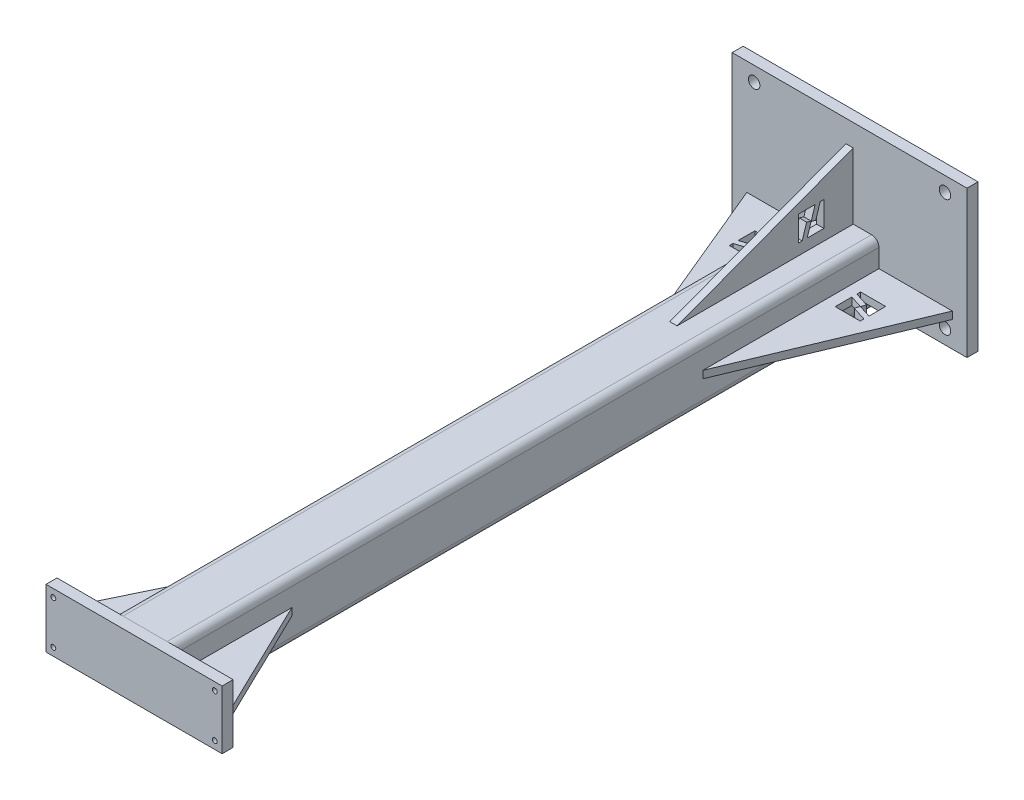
ISO-10303-21;
HEADER;
FILE_DESCRIPTION(('STEP AP214'),'2;1');
FILE_NAME('part.step','',(''),(''),'','','');
FILE_SCHEMA(('AUTOMOTIVE_DESIGN { 1 0 10303 214 1 1 1 1 }'));
ENDSEC;
DATA;
#1=APPLICATION_CONTEXT('core data for automotive mechanical design processes');
#2=APPLICATION_PROTOCOL_DEFINITION('international standard','automotive_design',2000,#1);
#3=PRODUCT_CONTEXT('',#1,'mechanical');
#4=PRODUCT('Part','Part','',(#3));
#5=PRODUCT_RELATED_PRODUCT_CATEGORY('part','',(#4));
#6=PRODUCT_DEFINITION_FORMATION('','',#4);
#7=PRODUCT_DEFINITION_CONTEXT('part definition',#1,'design');
#8=PRODUCT_DEFINITION('design','',#6,#7);
#9=PRODUCT_DEFINITION_SHAPE('','',#8);
#10=(LENGTH_UNIT() NAMED_UNIT(*) SI_UNIT(.MILLI.,.METRE.));
#11=(NAMED_UNIT(*) PLANE_ANGLE_UNIT() SI_UNIT($,.RADIAN.));
#12=(NAMED_UNIT(*) SI_UNIT($,.STERADIAN.) SOLID_ANGLE_UNIT());
#13=UNCERTAINTY_MEASURE_WITH_UNIT(LENGTH_MEASURE(1.E-05),#10,'distance_accuracy_value','');
#14=(GEOMETRIC_REPRESENTATION_CONTEXT(3) GLOBAL_UNCERTAINTY_ASSIGNED_CONTEXT((#13)) GLOBAL_UNIT_ASSIGNED_CONTEXT((#10,
#11,#12)) REPRESENTATION_CONTEXT('',''));
#15=CARTESIAN_POINT('',(0.,0.,0.));
#16=DIRECTION('',(0.,0.,1.));
#17=DIRECTION('',(1.,0.,0.));
#18=AXIS2_PLACEMENT_3D('',#15,#16,#17);
#19=CARTESIAN_POINT('',(-149.225,6.35000000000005,0.));
#20=DIRECTION('',(0.,0.,-1.));
#21=DIRECTION('',(1.,0.,0.));
#22=AXIS2_PLACEMENT_3D('',#19,#20,#21);
#23=PLANE('',#22);
#24=DIRECTION('',(-1.,0.,0.));
#25=VECTOR('',#24,1.);
#26=CARTESIAN_POINT('',(-149.225,-6.34999999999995,0.));
#27=LINE('',#26,#25);
#28=CARTESIAN_POINT('',(-50.8,-6.34999999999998,0.));
#29=VERTEX_POINT('',#28);
#30=CARTESIAN_POINT('',(-149.225,-6.34999999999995,0.));
#31=VERTEX_POINT('',#30);
#32=EDGE_CURVE('E146',#29,#31,#27,.T.);
#33=ORIENTED_EDGE('',*,*,#32,.F.);
#34=DIRECTION('',(0.,-1.,0.));
#35=VECTOR('',#34,1.);
#36=CARTESIAN_POINT('',(-50.8,6.35000000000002,0.));
#37=LINE('',#36,#35);
#38=CARTESIAN_POINT('',(-50.8,6.35000000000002,0.));
#39=VERTEX_POINT('',#38);
#40=EDGE_CURVE('E141',#39,#29,#37,.T.);
#41=ORIENTED_EDGE('',*,*,#40,.F.);
#42=DIRECTION('',(-1.,0.,0.));
#43=VECTOR('',#42,1.);
#44=CARTESIAN_POINT('',(-149.225,6.35000000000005,0.));
#45=LINE('',#44,#43);
#46=CARTESIAN_POINT('',(-149.225,6.35000000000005,0.));
#47=VERTEX_POINT('',#46);
#48=EDGE_CURVE('E133',#39,#47,#45,.T.);
#49=ORIENTED_EDGE('',*,*,#48,.T.);
#50=DIRECTION('',(0.,-1.,0.));
#51=VECTOR('',#50,1.);
#52=CARTESIAN_POINT('',(-149.225,6.35000000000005,0.));
#53=LINE('',#52,#51);
#54=EDGE_CURVE('E13',#47,#31,#53,.T.);
#55=ORIENTED_EDGE('',*,*,#54,.T.);
#56=EDGE_LOOP('',(#33,#41,#49,#55));
#57=FACE_BOUND('',#56,.T.);
#58=ADVANCED_FACE('F94',(#57),#23,.F.);
#59=CARTESIAN_POINT('',(-149.225,6.35000000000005,0.));
#60=DIRECTION('',(0.899981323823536,0.,0.435928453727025));
#61=DIRECTION('',(-0.435928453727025,0.,0.899981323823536));
#62=AXIS2_PLACEMENT_3D('',#59,#60,#61);
#63=PLANE('',#62);
#64=DIRECTION('',(0.435928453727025,0.,-0.899981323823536));
#65=VECTOR('',#64,1.);
#66=CARTESIAN_POINT('',(-149.225,-6.34999999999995,0.));
#67=LINE('',#66,#65);
#68=CARTESIAN_POINT('',(-50.8,-6.34999999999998,-203.2));
#69=VERTEX_POINT('',#68);
#70=EDGE_CURVE('E138',#31,#69,#67,.T.);
#71=ORIENTED_EDGE('',*,*,#70,.F.);
#72=ORIENTED_EDGE('',*,*,#54,.F.);
#73=DIRECTION('',(0.435928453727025,0.,-0.899981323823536));
#74=VECTOR('',#73,1.);
#75=CARTESIAN_POINT('',(-149.225,6.35000000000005,0.));
#76=LINE('',#75,#74);
#77=CARTESIAN_POINT('',(-50.8,6.35000000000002,-203.2));
#78=VERTEX_POINT('',#77);
#79=EDGE_CURVE('E129',#47,#78,#76,.T.);
#80=ORIENTED_EDGE('',*,*,#79,.T.);
#81=DIRECTION('',(0.,-1.,0.));
#82=VECTOR('',#81,1.);
#83=CARTESIAN_POINT('',(-50.8,6.35000000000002,-203.2));
#84=LINE('',#83,#82);
#85=EDGE_CURVE('E102',#78,#69,#84,.T.);
#86=ORIENTED_EDGE('',*,*,#85,.T.);
#87=EDGE_LOOP('',(#71,#72,#80,#86));
#88=FACE_BOUND('',#87,.T.);
#89=ADVANCED_FACE('F137',(#88),#63,.F.);
#90=CARTESIAN_POINT('',(-50.8,6.35000000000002,0.));
#91=DIRECTION('',(-1.,0.,0.));
#92=DIRECTION('',(0.,0.,-1.));
#93=AXIS2_PLACEMENT_3D('',#90,#91,#92);
#94=PLANE('',#93);
#95=DIRECTION('',(0.,0.,1.));
#96=VECTOR('',#95,1.);
#97=CARTESIAN_POINT('',(-50.8,-6.34999999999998,0.));
#98=LINE('',#97,#96);
#99=EDGE_CURVE('E121',#69,#29,#98,.T.);
#100=ORIENTED_EDGE('',*,*,#99,.F.);
#101=ORIENTED_EDGE('',*,*,#85,.F.);
#102=DIRECTION('',(0.,0.,1.));
#103=VECTOR('',#102,1.);
#104=CARTESIAN_POINT('',(-50.8,6.35000000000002,0.));
#105=LINE('',#104,#103);
#106=EDGE_CURVE('E110',#78,#39,#105,.T.);
#107=ORIENTED_EDGE('',*,*,#106,.T.);
#108=ORIENTED_EDGE('',*,*,#40,.T.);
#109=EDGE_LOOP('',(#100,#101,#107,#108));
#110=FACE_BOUND('',#109,.T.);
#111=ADVANCED_FACE('F155',(#110),#94,.F.);
#112=CARTESIAN_POINT('',(0.,6.35,0.));
#113=DIRECTION('',(0.,-1.,0.));
#114=DIRECTION('',(0.,0.,-1.));
#115=AXIS2_PLACEMENT_3D('',#112,#113,#114);
#116=PLANE('',#115);
#117=ORIENTED_EDGE('',*,*,#48,.F.);
#118=ORIENTED_EDGE('',*,*,#106,.F.);
#119=ORIENTED_EDGE('',*,*,#79,.F.);
#120=EDGE_LOOP('',(#117,#118,#119));
#121=FACE_BOUND('',#120,.T.);
#122=ADVANCED_FACE('F131',(#121),#116,.F.);
#123=CARTESIAN_POINT('',(0.,-6.35,0.));
#124=DIRECTION('',(0.,-1.,0.));
#125=DIRECTION('',(0.,0.,-1.));
#126=AXIS2_PLACEMENT_3D('',#123,#124,#125);
#127=PLANE('',#126);
#128=ORIENTED_EDGE('',*,*,#32,.T.);
#129=ORIENTED_EDGE('',*,*,#70,.T.);
#130=ORIENTED_EDGE('',*,*,#99,.T.);
#131=EDGE_LOOP('',(#128,#129,#130));
#132=FACE_BOUND('',#131,.T.);
#133=ADVANCED_FACE('F149',(#132),#127,.T.);
#134=CLOSED_SHELL('',(#58,#89,#111,#122,#133));
#135=MANIFOLD_SOLID_BREP('B2',#134);
#136=CARTESIAN_POINT('',(149.225,6.35,0.));
#137=DIRECTION('',(0.,0.,-1.));
#138=DIRECTION('',(-1.,0.,0.));
#139=AXIS2_PLACEMENT_3D('',#136,#137,#138);
#140=PLANE('',#139);
#141=DIRECTION('',(1.,0.,0.));
#142=VECTOR('',#141,1.);
#143=CARTESIAN_POINT('',(149.225,-6.35,0.));
#144=LINE('',#143,#142);
#145=CARTESIAN_POINT('',(50.8,-6.35,0.));
#146=VERTEX_POINT('',#145);
#147=CARTESIAN_POINT('',(149.225,-6.35,0.));
#148=VERTEX_POINT('',#147);
#149=EDGE_CURVE('E249',#146,#148,#144,.T.);
#150=ORIENTED_EDGE('',*,*,#149,.T.);
#151=DIRECTION('',(0.,-1.,0.));
#152=VECTOR('',#151,1.);
#153=CARTESIAN_POINT('',(149.225,6.35,0.));
#154=LINE('',#153,#152);
#155=CARTESIAN_POINT('',(149.225,6.35,0.));
#156=VERTEX_POINT('',#155);
#157=EDGE_CURVE('E92',#156,#148,#154,.T.);
#158=ORIENTED_EDGE('',*,*,#157,.F.);
#159=DIRECTION('',(1.,0.,0.));
#160=VECTOR('',#159,1.);
#161=CARTESIAN_POINT('',(149.225,6.35,0.));
#162=LINE('',#161,#160);
#163=CARTESIAN_POINT('',(50.8,6.35,0.));
#164=VERTEX_POINT('',#163);
#165=EDGE_CURVE('E242',#164,#156,#162,.T.);
#166=ORIENTED_EDGE('',*,*,#165,.F.);
#167=DIRECTION('',(0.,-1.,0.));
#168=VECTOR('',#167,1.);
#169=CARTESIAN_POINT('',(50.8,6.35,0.));
#170=LINE('',#169,#168);
#171=EDGE_CURVE('E250',#164,#146,#170,.T.);
#172=ORIENTED_EDGE('',*,*,#171,.T.);
#173=EDGE_LOOP('',(#150,#158,#166,#172));
#174=FACE_BOUND('',#173,.T.);
#175=ADVANCED_FACE('F202',(#174),#140,.F.);
#176=CARTESIAN_POINT('',(149.225,6.35,0.));
#177=DIRECTION('',(-0.899981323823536,0.,0.435928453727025));
#178=DIRECTION('',(0.435928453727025,0.,0.899981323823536));
#179=AXIS2_PLACEMENT_3D('',#176,#177,#178);
#180=PLANE('',#179);
#181=DIRECTION('',(-0.435928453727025,0.,-0.899981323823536));
#182=VECTOR('',#181,1.);
#183=CARTESIAN_POINT('',(149.225,-6.35,0.));
#184=LINE('',#183,#182);
#185=CARTESIAN_POINT('',(50.8,-6.35,-203.2));
#186=VERTEX_POINT('',#185);
#187=EDGE_CURVE('E230',#148,#186,#184,.T.);
#188=ORIENTED_EDGE('',*,*,#187,.T.);
#189=DIRECTION('',(0.,-1.,0.));
#190=VECTOR('',#189,1.);
#191=CARTESIAN_POINT('',(50.8,6.35,-203.2));
#192=LINE('',#191,#190);
#193=CARTESIAN_POINT('',(50.8,6.35,-203.2));
#194=VERTEX_POINT('',#193);
#195=EDGE_CURVE('E210',#194,#186,#192,.T.);
#196=ORIENTED_EDGE('',*,*,#195,.F.);
#197=DIRECTION('',(-0.435928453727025,0.,-0.899981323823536));
#198=VECTOR('',#197,1.);
#199=CARTESIAN_POINT('',(149.225,6.35,0.));
#200=LINE('',#199,#198);
#201=EDGE_CURVE('E238',#156,#194,#200,.T.);
#202=ORIENTED_EDGE('',*,*,#201,.F.);
#203=ORIENTED_EDGE('',*,*,#157,.T.);
#204=EDGE_LOOP('',(#188,#196,#202,#203));
#205=FACE_BOUND('',#204,.T.);
#206=ADVANCED_FACE('F239',(#205),#180,.F.);
#207=CARTESIAN_POINT('',(50.8,6.35,0.));
#208=DIRECTION('',(1.,0.,0.));
#209=DIRECTION('',(0.,0.,-1.));
#210=AXIS2_PLACEMENT_3D('',#207,#208,#209);
#211=PLANE('',#210);
#212=DIRECTION('',(0.,0.,1.));
#213=VECTOR('',#212,1.);
#214=CARTESIAN_POINT('',(50.8,-6.35,0.));
#215=LINE('',#214,#213);
#216=EDGE_CURVE('E235',#186,#146,#215,.T.);
#217=ORIENTED_EDGE('',*,*,#216,.T.);
#218=ORIENTED_EDGE('',*,*,#171,.F.);
#219=DIRECTION('',(0.,0.,1.));
#220=VECTOR('',#219,1.);
#221=CARTESIAN_POINT('',(50.8,6.35,0.));
#222=LINE('',#221,#220);
#223=EDGE_CURVE('E218',#194,#164,#222,.T.);
#224=ORIENTED_EDGE('',*,*,#223,.F.);
#225=ORIENTED_EDGE('',*,*,#195,.T.);
#226=EDGE_LOOP('',(#217,#218,#224,#225));
#227=FACE_BOUND('',#226,.T.);
#228=ADVANCED_FACE('F257',(#227),#211,.F.);
#229=CARTESIAN_POINT('',(0.,6.35,0.));
#230=DIRECTION('',(0.,-1.,0.));
#231=DIRECTION('',(0.,0.,-1.));
#232=AXIS2_PLACEMENT_3D('',#229,#230,#231);
#233=PLANE('',#232);
#234=ORIENTED_EDGE('',*,*,#165,.T.);
#235=ORIENTED_EDGE('',*,*,#201,.T.);
#236=ORIENTED_EDGE('',*,*,#223,.T.);
#237=EDGE_LOOP('',(#234,#235,#236));
#238=FACE_BOUND('',#237,.T.);
#239=ADVANCED_FACE('F245',(#238),#233,.F.);
#240=CARTESIAN_POINT('',(0.,-6.35,0.));
#241=DIRECTION('',(0.,-1.,0.));
#242=DIRECTION('',(0.,0.,-1.));
#243=AXIS2_PLACEMENT_3D('',#240,#241,#242);
#244=PLANE('',#243);
#245=ORIENTED_EDGE('',*,*,#149,.F.);
#246=ORIENTED_EDGE('',*,*,#216,.F.);
#247=ORIENTED_EDGE('',*,*,#187,.F.);
#248=EDGE_LOOP('',(#245,#246,#247));
#249=FACE_BOUND('',#248,.T.);
#250=ADVANCED_FACE('F258',(#249),#244,.T.);
#251=CLOSED_SHELL('',(#175,#206,#228,#239,#250));
#252=MANIFOLD_SOLID_BREP('B7',#251);
#253=CARTESIAN_POINT('',(0.,0.,0.));
#254=DIRECTION('',(0.,0.,1.));
#255=DIRECTION('',(1.,0.,0.));
#256=AXIS2_PLACEMENT_3D('',#253,#254,#255);
#257=PLANE('',#256);
#258=CARTESIAN_POINT('',(139.7,-37.3125999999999,0.));
#259=DIRECTION('',(0.,0.,-1.));
#260=DIRECTION('',(-1.,0.,0.));
#261=AXIS2_PLACEMENT_3D('',#258,#259,#260);
#262=CIRCLE('',#261,4.21640000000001);
#263=CARTESIAN_POINT('',(135.4836,-37.3125999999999,0.));
#264=VERTEX_POINT('',#263);
#265=EDGE_CURVE('E402',#264,#264,#262,.T.);
#266=ORIENTED_EDGE('',*,*,#265,.F.);
#267=EDGE_LOOP('',(#266));
#268=FACE_BOUND('',#267,.T.);
#269=CARTESIAN_POINT('',(-139.7,37.3126000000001,0.));
#270=DIRECTION('',(0.,0.,-1.));
#271=DIRECTION('',(-1.,0.,0.));
#272=AXIS2_PLACEMENT_3D('',#269,#270,#271);
#273=CIRCLE('',#272,4.21640000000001);
#274=CARTESIAN_POINT('',(-143.9164,37.3126000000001,0.));
#275=VERTEX_POINT('',#274);
#276=EDGE_CURVE('E396',#275,#275,#273,.T.);
#277=ORIENTED_EDGE('',*,*,#276,.F.);
#278=EDGE_LOOP('',(#277));
#279=FACE_BOUND('',#278,.T.);
#280=CARTESIAN_POINT('',(-139.7,-37.3125999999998,0.));
#281=DIRECTION('',(0.,0.,-1.));
#282=DIRECTION('',(-1.,0.,0.));
#283=AXIS2_PLACEMENT_3D('',#280,#281,#282);
#284=CIRCLE('',#283,4.21640000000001);
#285=CARTESIAN_POINT('',(-143.9164,-37.3125999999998,0.));
#286=VERTEX_POINT('',#285);
#287=EDGE_CURVE('E390',#286,#286,#284,.T.);
#288=ORIENTED_EDGE('',*,*,#287,.F.);
#289=EDGE_LOOP('',(#288));
#290=FACE_BOUND('',#289,.T.);
#291=DIRECTION('',(-1.,0.,0.));
#292=VECTOR('',#291,1.);
#293=CARTESIAN_POINT('',(152.4,50.8,0.));
#294=LINE('',#293,#292);
#295=CARTESIAN_POINT('',(152.4,50.8,0.));
#296=VERTEX_POINT('',#295);
#297=CARTESIAN_POINT('',(-152.4,50.8,0.));
#298=VERTEX_POINT('',#297);
#299=EDGE_CURVE('E374',#296,#298,#294,.T.);
#300=ORIENTED_EDGE('',*,*,#299,.F.);
#301=DIRECTION('',(0.,1.,0.));
#302=VECTOR('',#301,1.);
#303=CARTESIAN_POINT('',(152.4,-50.8,0.));
#304=LINE('',#303,#302);
#305=CARTESIAN_POINT('',(152.4,-50.8,0.));
#306=VERTEX_POINT('',#305);
#307=EDGE_CURVE('E350',#306,#296,#304,.T.);
#308=ORIENTED_EDGE('',*,*,#307,.F.);
#309=DIRECTION('',(1.,0.,0.));
#310=VECTOR('',#309,1.);
#311=CARTESIAN_POINT('',(-152.4,-50.8,0.));
#312=LINE('',#311,#310);
#313=CARTESIAN_POINT('',(-152.4,-50.8,0.));
#314=VERTEX_POINT('',#313);
#315=EDGE_CURVE('E344',#314,#306,#312,.T.);
#316=ORIENTED_EDGE('',*,*,#315,.F.);
#317=DIRECTION('',(0.,-1.,0.));
#318=VECTOR('',#317,1.);
#319=CARTESIAN_POINT('',(-152.4,50.8,0.));
#320=LINE('',#319,#318);
#321=EDGE_CURVE('E366',#298,#314,#320,.T.);
#322=ORIENTED_EDGE('',*,*,#321,.F.);
#323=EDGE_LOOP('',(#300,#308,#316,#322));
#324=FACE_BOUND('',#323,.T.);
#325=CARTESIAN_POINT('',(139.7,37.3126000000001,0.));
#326=DIRECTION('',(0.,0.,-1.));
#327=DIRECTION('',(-1.,0.,0.));
#328=AXIS2_PLACEMENT_3D('',#325,#326,#327);
#329=CIRCLE('',#328,4.21640000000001);
#330=CARTESIAN_POINT('',(135.4836,37.3126000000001,0.));
#331=VERTEX_POINT('',#330);
#332=EDGE_CURVE('E408',#331,#331,#329,.T.);
#333=ORIENTED_EDGE('',*,*,#332,.F.);
#334=EDGE_LOOP('',(#333));
#335=FACE_BOUND('',#334,.T.);
#336=ADVANCED_FACE('F310',(#268,#279,#290,#324,#335),#257,.F.);
#337=CARTESIAN_POINT('',(152.4,50.8,19.05));
#338=DIRECTION('',(0.,-1.,0.));
#339=DIRECTION('',(1.,0.,0.));
#340=AXIS2_PLACEMENT_3D('',#337,#338,#339);
#341=PLANE('',#340);
#342=ORIENTED_EDGE('',*,*,#299,.T.);
#343=DIRECTION('',(0.,0.,-1.));
#344=VECTOR('',#343,1.);
#345=CARTESIAN_POINT('',(-152.4,50.8,19.05));
#346=LINE('',#345,#344);
#347=CARTESIAN_POINT('',(-152.4,50.8,19.05));
#348=VERTEX_POINT('',#347);
#349=EDGE_CURVE('E200',#348,#298,#346,.T.);
#350=ORIENTED_EDGE('',*,*,#349,.F.);
#351=DIRECTION('',(-1.,0.,0.));
#352=VECTOR('',#351,1.);
#353=CARTESIAN_POINT('',(152.4,50.8,19.05));
#354=LINE('',#353,#352);
#355=CARTESIAN_POINT('',(152.4,50.8,19.05));
#356=VERTEX_POINT('',#355);
#357=EDGE_CURVE('E362',#356,#348,#354,.T.);
#358=ORIENTED_EDGE('',*,*,#357,.F.);
#359=DIRECTION('',(0.,0.,-1.));
#360=VECTOR('',#359,1.);
#361=CARTESIAN_POINT('',(152.4,50.8,19.05));
#362=LINE('',#361,#360);
#363=EDGE_CURVE('E370',#356,#296,#362,.T.);
#364=ORIENTED_EDGE('',*,*,#363,.T.);
#365=EDGE_LOOP('',(#342,#350,#358,#364));
#366=FACE_BOUND('',#365,.T.);
#367=ADVANCED_FACE('F312',(#366),#341,.F.);
#368=CARTESIAN_POINT('',(-152.4,50.8,19.05));
#369=DIRECTION('',(1.,0.,0.));
#370=DIRECTION('',(0.,1.,0.));
#371=AXIS2_PLACEMENT_3D('',#368,#369,#370);
#372=PLANE('',#371);
#373=ORIENTED_EDGE('',*,*,#321,.T.);
#374=DIRECTION('',(0.,0.,-1.));
#375=VECTOR('',#374,1.);
#376=CARTESIAN_POINT('',(-152.4,-50.8,19.05));
#377=LINE('',#376,#375);
#378=CARTESIAN_POINT('',(-152.4,-50.8,19.05));
#379=VERTEX_POINT('',#378);
#380=EDGE_CURVE('E319',#379,#314,#377,.T.);
#381=ORIENTED_EDGE('',*,*,#380,.F.);
#382=DIRECTION('',(0.,-1.,0.));
#383=VECTOR('',#382,1.);
#384=CARTESIAN_POINT('',(-152.4,50.8,19.05));
#385=LINE('',#384,#383);
#386=EDGE_CURVE('E357',#348,#379,#385,.T.);
#387=ORIENTED_EDGE('',*,*,#386,.F.);
#388=ORIENTED_EDGE('',*,*,#349,.T.);
#389=EDGE_LOOP('',(#373,#381,#387,#388));
#390=FACE_BOUND('',#389,.T.);
#391=ADVANCED_FACE('F365',(#390),#372,.F.);
#392=CARTESIAN_POINT('',(-152.4,-50.8,19.05));
#393=DIRECTION('',(0.,1.,0.));
#394=DIRECTION('',(-1.,0.,0.));
#395=AXIS2_PLACEMENT_3D('',#392,#393,#394);
#396=PLANE('',#395);
#397=ORIENTED_EDGE('',*,*,#315,.T.);
#398=DIRECTION('',(0.,0.,-1.));
#399=VECTOR('',#398,1.);
#400=CARTESIAN_POINT('',(152.4,-50.8,19.05));
#401=LINE('',#400,#399);
#402=CARTESIAN_POINT('',(152.4,-50.8,19.05));
#403=VERTEX_POINT('',#402);
#404=EDGE_CURVE('E367',#403,#306,#401,.T.);
#405=ORIENTED_EDGE('',*,*,#404,.F.);
#406=DIRECTION('',(1.,0.,0.));
#407=VECTOR('',#406,1.);
#408=CARTESIAN_POINT('',(-152.4,-50.8,19.05));
#409=LINE('',#408,#407);
#410=EDGE_CURVE('E360',#379,#403,#409,.T.);
#411=ORIENTED_EDGE('',*,*,#410,.F.);
#412=ORIENTED_EDGE('',*,*,#380,.T.);
#413=EDGE_LOOP('',(#397,#405,#411,#412));
#414=FACE_BOUND('',#413,.T.);
#415=ADVANCED_FACE('F368',(#414),#396,.F.);
#416=CARTESIAN_POINT('',(152.4,-50.8,19.05));
#417=DIRECTION('',(-1.,0.,0.));
#418=DIRECTION('',(0.,-1.,0.));
#419=AXIS2_PLACEMENT_3D('',#416,#417,#418);
#420=PLANE('',#419);
#421=ORIENTED_EDGE('',*,*,#307,.T.);
#422=ORIENTED_EDGE('',*,*,#363,.F.);
#423=DIRECTION('',(0.,1.,0.));
#424=VECTOR('',#423,1.);
#425=CARTESIAN_POINT('',(152.4,-50.8,19.05));
#426=LINE('',#425,#424);
#427=EDGE_CURVE('E327',#403,#356,#426,.T.);
#428=ORIENTED_EDGE('',*,*,#427,.F.);
#429=ORIENTED_EDGE('',*,*,#404,.T.);
#430=EDGE_LOOP('',(#421,#422,#428,#429));
#431=FACE_BOUND('',#430,.T.);
#432=ADVANCED_FACE('F382',(#431),#420,.F.);
#433=CARTESIAN_POINT('',(0.,0.,19.05));
#434=DIRECTION('',(0.,0.,1.));
#435=DIRECTION('',(1.,0.,0.));
#436=AXIS2_PLACEMENT_3D('',#433,#434,#435);
#437=PLANE('',#436);
#438=CARTESIAN_POINT('',(139.7,37.3126000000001,19.05));
#439=DIRECTION('',(0.,0.,-1.));
#440=DIRECTION('',(-1.,0.,0.));
#441=AXIS2_PLACEMENT_3D('',#438,#439,#440);
#442=CIRCLE('',#441,4.21640000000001);
#443=CARTESIAN_POINT('',(135.4836,37.3126000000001,19.05));
#444=VERTEX_POINT('',#443);
#445=EDGE_CURVE('E405',#444,#444,#442,.T.);
#446=ORIENTED_EDGE('',*,*,#445,.T.);
#447=EDGE_LOOP('',(#446));
#448=FACE_BOUND('',#447,.T.);
#449=CARTESIAN_POINT('',(139.7,-37.3125999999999,19.05));
#450=DIRECTION('',(0.,0.,-1.));
#451=DIRECTION('',(-1.,0.,0.));
#452=AXIS2_PLACEMENT_3D('',#449,#450,#451);
#453=CIRCLE('',#452,4.21640000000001);
#454=CARTESIAN_POINT('',(135.4836,-37.3125999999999,19.05));
#455=VERTEX_POINT('',#454);
#456=EDGE_CURVE('E399',#455,#455,#453,.T.);
#457=ORIENTED_EDGE('',*,*,#456,.T.);
#458=EDGE_LOOP('',(#457));
#459=FACE_BOUND('',#458,.T.);
#460=CARTESIAN_POINT('',(-139.7,37.3126000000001,19.05));
#461=DIRECTION('',(0.,0.,-1.));
#462=DIRECTION('',(-1.,0.,0.));
#463=AXIS2_PLACEMENT_3D('',#460,#461,#462);
#464=CIRCLE('',#463,4.21640000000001);
#465=CARTESIAN_POINT('',(-143.9164,37.3126000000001,19.05));
#466=VERTEX_POINT('',#465);
#467=EDGE_CURVE('E393',#466,#466,#464,.T.);
#468=ORIENTED_EDGE('',*,*,#467,.T.);
#469=EDGE_LOOP('',(#468));
#470=FACE_BOUND('',#469,.T.);
#471=CARTESIAN_POINT('',(-139.7,-37.3125999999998,19.05));
#472=DIRECTION('',(0.,0.,-1.));
#473=DIRECTION('',(-1.,0.,0.));
#474=AXIS2_PLACEMENT_3D('',#471,#472,#473);
#475=CIRCLE('',#474,4.21640000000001);
#476=CARTESIAN_POINT('',(-143.9164,-37.3125999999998,19.05));
#477=VERTEX_POINT('',#476);
#478=EDGE_CURVE('E377',#477,#477,#475,.T.);
#479=ORIENTED_EDGE('',*,*,#478,.T.);
#480=EDGE_LOOP('',(#479));
#481=FACE_BOUND('',#480,.T.);
#482=ORIENTED_EDGE('',*,*,#357,.T.);
#483=ORIENTED_EDGE('',*,*,#386,.T.);
#484=ORIENTED_EDGE('',*,*,#410,.T.);
#485=ORIENTED_EDGE('',*,*,#427,.T.);
#486=EDGE_LOOP('',(#482,#483,#484,#485));
#487=FACE_BOUND('',#486,.T.);
#488=ADVANCED_FACE('F358',(#448,#459,#470,#481,#487),#437,.T.);
#489=CARTESIAN_POINT('',(-139.7,-37.3125999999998,0.));
#490=DIRECTION('',(0.,0.,-1.));
#491=DIRECTION('',(-1.,0.,0.));
#492=AXIS2_PLACEMENT_3D('',#489,#490,#491);
#493=CYLINDRICAL_SURFACE('',#492,4.21640000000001);
#494=ORIENTED_EDGE('',*,*,#478,.F.);
#495=EDGE_LOOP('',(#494));
#496=FACE_BOUND('',#495,.T.);
#497=ORIENTED_EDGE('',*,*,#287,.T.);
#498=EDGE_LOOP('',(#497));
#499=FACE_BOUND('',#498,.T.);
#500=ADVANCED_FACE('F446',(#496,#499),#493,.F.);
#501=CARTESIAN_POINT('',(-139.7,37.3126000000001,0.));
#502=DIRECTION('',(0.,0.,-1.));
#503=DIRECTION('',(-1.,0.,0.));
#504=AXIS2_PLACEMENT_3D('',#501,#502,#503);
#505=CYLINDRICAL_SURFACE('',#504,4.21640000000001);
#506=ORIENTED_EDGE('',*,*,#467,.F.);
#507=EDGE_LOOP('',(#506));
#508=FACE_BOUND('',#507,.T.);
#509=ORIENTED_EDGE('',*,*,#276,.T.);
#510=EDGE_LOOP('',(#509));
#511=FACE_BOUND('',#510,.T.);
#512=ADVANCED_FACE('F453',(#508,#511),#505,.F.);
#513=CARTESIAN_POINT('',(139.7,-37.3125999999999,0.));
#514=DIRECTION('',(0.,0.,-1.));
#515=DIRECTION('',(-1.,0.,0.));
#516=AXIS2_PLACEMENT_3D('',#513,#514,#515);
#517=CYLINDRICAL_SURFACE('',#516,4.21640000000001);
#518=ORIENTED_EDGE('',*,*,#456,.F.);
#519=EDGE_LOOP('',(#518));
#520=FACE_BOUND('',#519,.T.);
#521=ORIENTED_EDGE('',*,*,#265,.T.);
#522=EDGE_LOOP('',(#521));
#523=FACE_BOUND('',#522,.T.);
#524=ADVANCED_FACE('F460',(#520,#523),#517,.F.);
#525=CARTESIAN_POINT('',(139.7,37.3126000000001,0.));
#526=DIRECTION('',(0.,0.,-1.));
#527=DIRECTION('',(-1.,0.,0.));
#528=AXIS2_PLACEMENT_3D('',#525,#526,#527);
#529=CYLINDRICAL_SURFACE('',#528,4.21640000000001);
#530=ORIENTED_EDGE('',*,*,#445,.F.);
#531=EDGE_LOOP('',(#530));
#532=FACE_BOUND('',#531,.T.);
#533=ORIENTED_EDGE('',*,*,#332,.T.);
#534=EDGE_LOOP('',(#533));
#535=FACE_BOUND('',#534,.T.);
#536=ADVANCED_FACE('F412',(#532,#535),#529,.F.);
#537=CLOSED_SHELL('',(#336,#367,#391,#415,#432,#488,#500,#512,#524,#536));
#538=MANIFOLD_SOLID_BREP('B86',#537);
#539=CARTESIAN_POINT('',(50.8,-6.35,-914.4));
#540=DIRECTION('',(-0.923076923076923,0.,-0.384615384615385));
#541=DIRECTION('',(0.384615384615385,0.,-0.923076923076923));
#542=AXIS2_PLACEMENT_3D('',#539,#540,#541);
#543=PLANE('',#542);
#544=DIRECTION('',(0.384615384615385,0.,-0.923076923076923));
#545=VECTOR('',#544,1.);
#546=CARTESIAN_POINT('',(50.8,6.35,-914.4));
#547=LINE('',#546,#545);
#548=CARTESIAN_POINT('',(50.8,6.35,-914.4));
#549=VERTEX_POINT('',#548);
#550=CARTESIAN_POINT('',(177.8,6.34999999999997,-1219.2));
#551=VERTEX_POINT('',#550);
#552=EDGE_CURVE('E735',#549,#551,#547,.T.);
#553=ORIENTED_EDGE('',*,*,#552,.F.);
#554=DIRECTION('',(0.,1.,0.));
#555=VECTOR('',#554,1.);
#556=CARTESIAN_POINT('',(50.8,-6.35,-914.4));
#557=LINE('',#556,#555);
#558=CARTESIAN_POINT('',(50.8,-6.35,-914.4));
#559=VERTEX_POINT('',#558);
#560=EDGE_CURVE('E745',#559,#549,#557,.T.);
#561=ORIENTED_EDGE('',*,*,#560,.F.);
#562=DIRECTION('',(0.384615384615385,0.,-0.923076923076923));
#563=VECTOR('',#562,1.);
#564=CARTESIAN_POINT('',(50.8,-6.35,-914.4));
#565=LINE('',#564,#563);
#566=CARTESIAN_POINT('',(177.8,-6.35000000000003,-1219.2));
#567=VERTEX_POINT('',#566);
#568=EDGE_CURVE('E736',#559,#567,#565,.T.);
#569=ORIENTED_EDGE('',*,*,#568,.T.);
#570=DIRECTION('',(0.,1.,0.));
#571=VECTOR('',#570,1.);
#572=CARTESIAN_POINT('',(177.8,-6.35000000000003,-1219.2));
#573=LINE('',#572,#571);
#574=EDGE_CURVE('E308',#567,#551,#573,.T.);
#575=ORIENTED_EDGE('',*,*,#574,.T.);
#576=EDGE_LOOP('',(#553,#561,#569,#575));
#577=FACE_BOUND('',#576,.T.);
#578=ADVANCED_FACE('F528',(#577),#543,.F.);
#579=CARTESIAN_POINT('',(50.8,-6.35,-1219.2));
#580=DIRECTION('',(0.,0.,1.));
#581=DIRECTION('',(-1.,0.,0.));
#582=AXIS2_PLACEMENT_3D('',#579,#580,#581);
#583=PLANE('',#582);
#584=DIRECTION('',(-1.,0.,0.));
#585=VECTOR('',#584,1.);
#586=CARTESIAN_POINT('',(50.8,6.35,-1219.2));
#587=LINE('',#586,#585);
#588=CARTESIAN_POINT('',(50.8,6.35,-1219.2));
#589=VERTEX_POINT('',#588);
#590=EDGE_CURVE('E748',#551,#589,#587,.T.);
#591=ORIENTED_EDGE('',*,*,#590,.F.);
#592=ORIENTED_EDGE('',*,*,#574,.F.);
#593=DIRECTION('',(-1.,0.,0.));
#594=VECTOR('',#593,1.);
#595=CARTESIAN_POINT('',(50.8,-6.35,-1219.2));
#596=LINE('',#595,#594);
#597=CARTESIAN_POINT('',(50.8,-6.35,-1219.2));
#598=VERTEX_POINT('',#597);
#599=EDGE_CURVE('E739',#567,#598,#596,.T.);
#600=ORIENTED_EDGE('',*,*,#599,.T.);
#601=DIRECTION('',(0.,1.,0.));
#602=VECTOR('',#601,1.);
#603=CARTESIAN_POINT('',(50.8,-6.35,-1219.2));
#604=LINE('',#603,#602);
#605=EDGE_CURVE('E535',#598,#589,#604,.T.);
#606=ORIENTED_EDGE('',*,*,#605,.T.);
#607=EDGE_LOOP('',(#591,#592,#600,#606));
#608=FACE_BOUND('',#607,.T.);
#609=ADVANCED_FACE('F756',(#608),#583,.F.);
#610=CARTESIAN_POINT('',(50.8,-6.35,-1219.2));
#611=DIRECTION('',(1.,0.,0.));
#612=DIRECTION('',(0.,-1.,0.));
#613=AXIS2_PLACEMENT_3D('',#610,#611,#612);
#614=PLANE('',#613);
#615=DIRECTION('',(0.,0.,1.));
#616=VECTOR('',#615,1.);
#617=CARTESIAN_POINT('',(50.8,6.35,-1219.2));
#618=LINE('',#617,#616);
#619=EDGE_CURVE('E740',#589,#549,#618,.T.);
#620=ORIENTED_EDGE('',*,*,#619,.F.);
#621=ORIENTED_EDGE('',*,*,#605,.F.);
#622=DIRECTION('',(0.,0.,1.));
#623=VECTOR('',#622,1.);
#624=CARTESIAN_POINT('',(50.8,-6.35,-1219.2));
#625=LINE('',#624,#623);
#626=EDGE_CURVE('E743',#598,#559,#625,.T.);
#627=ORIENTED_EDGE('',*,*,#626,.T.);
#628=ORIENTED_EDGE('',*,*,#560,.T.);
#629=EDGE_LOOP('',(#620,#621,#627,#628));
#630=FACE_BOUND('',#629,.T.);
#631=ADVANCED_FACE('F766',(#630),#614,.F.);
#632=CARTESIAN_POINT('',(0.,-6.35,0.));
#633=DIRECTION('',(0.,1.,0.));
#634=DIRECTION('',(1.,0.,0.));
#635=AXIS2_PLACEMENT_3D('',#632,#633,#634);
#636=PLANE('',#635);
#637=DIRECTION('',(0.00262452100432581,0.,0.999996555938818));
#638=VECTOR('',#637,1.);
#639=CARTESIAN_POINT('',(116.304479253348,-6.35000000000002,-0.305244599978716));
#640=LINE('',#639,#638);
#641=CARTESIAN_POINT('',(113.238779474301,-6.35000000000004,-1168.4));
#642=VERTEX_POINT('',#641);
#643=CARTESIAN_POINT('',(113.314599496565,-6.35000000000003,-1139.51100996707));
#644=VERTEX_POINT('',#643);
#645=EDGE_CURVE('E729',#642,#644,#640,.T.);
#646=ORIENTED_EDGE('',*,*,#645,.F.);
#647=DIRECTION('',(1.,0.,0.));
#648=VECTOR('',#647,1.);
#649=CARTESIAN_POINT('',(0.,-6.35,-1168.4));
#650=LINE('',#649,#648);
#651=CARTESIAN_POINT('',(69.8499999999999,-6.35000000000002,-1168.4));
#652=VERTEX_POINT('',#651);
#653=EDGE_CURVE('E726',#652,#642,#650,.T.);
#654=ORIENTED_EDGE('',*,*,#653,.F.);
#655=DIRECTION('',(0.,0.,-1.));
#656=VECTOR('',#655,1.);
#657=CARTESIAN_POINT('',(69.8499999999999,-6.35000000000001,0.));
#658=LINE('',#657,#656);
#659=CARTESIAN_POINT('',(69.8499999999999,-6.35000000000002,-1161.97491271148));
#660=VERTEX_POINT('',#659);
#661=EDGE_CURVE('E723',#660,#652,#658,.T.);
#662=ORIENTED_EDGE('',*,*,#661,.F.);
#663=DIRECTION('',(-0.953723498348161,0.,-0.300685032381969));
#664=VECTOR('',#663,1.);
#665=CARTESIAN_POINT('',(339.535230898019,-6.35000000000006,-1076.94994213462));
#666=LINE('',#665,#664);
#667=CARTESIAN_POINT('',(94.1818769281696,-6.35000000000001,-1154.30368387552));
#668=VERTEX_POINT('',#667);
#669=EDGE_CURVE('E721',#668,#660,#666,.T.);
#670=ORIENTED_EDGE('',*,*,#669,.F.);
#671=DIRECTION('',(0.289099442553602,0.,-0.957299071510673));
#672=VECTOR('',#671,1.);
#673=CARTESIAN_POINT('',(-233.148588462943,-6.34999999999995,-70.4096859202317));
#674=LINE('',#673,#672);
#675=CARTESIAN_POINT('',(91.7732513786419,-6.35000000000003,-1146.32796803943));
#676=VERTEX_POINT('',#675);
#677=EDGE_CURVE('E640',#676,#668,#674,.T.);
#678=ORIENTED_EDGE('',*,*,#677,.F.);
#679=DIRECTION('',(-0.953399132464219,0.,-0.30171193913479));
#680=VECTOR('',#679,1.);
#681=CARTESIAN_POINT('',(338.097546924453,-6.35000000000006,-1068.37637532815));
#682=LINE('',#681,#680);
#683=EDGE_CURVE('E732',#644,#676,#682,.T.);
#684=ORIENTED_EDGE('',*,*,#683,.F.);
#685=EDGE_LOOP('',(#646,#654,#662,#670,#678,#684));
#686=FACE_BOUND('',#685,.T.);
#687=DIRECTION('',(0.,0.,-1.));
#688=VECTOR('',#687,1.);
#689=CARTESIAN_POINT('',(69.8499999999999,-6.35000000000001,0.));
#690=LINE('',#689,#688);
#691=CARTESIAN_POINT('',(69.8499999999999,-6.35000000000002,-1124.4280968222));
#692=VERTEX_POINT('',#691);
#693=CARTESIAN_POINT('',(69.8499999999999,-6.35000000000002,-1153.30147155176));
#694=VERTEX_POINT('',#693);
#695=EDGE_CURVE('E714',#692,#694,#690,.T.);
#696=ORIENTED_EDGE('',*,*,#695,.F.);
#697=DIRECTION('',(-1.,0.,0.));
#698=VECTOR('',#697,1.);
#699=CARTESIAN_POINT('',(0.,-6.35,-1124.4280968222));
#700=LINE('',#699,#698);
#701=CARTESIAN_POINT('',(113.250509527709,-6.35000000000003,-1124.4280968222));
#702=VERTEX_POINT('',#701);
#703=EDGE_CURVE('E711',#702,#692,#700,.T.);
#704=ORIENTED_EDGE('',*,*,#703,.F.);
#705=DIRECTION('',(0.,0.,1.));
#706=VECTOR('',#705,1.);
#707=CARTESIAN_POINT('',(113.250509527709,-6.35000000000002,0.));
#708=LINE('',#707,#706);
#709=CARTESIAN_POINT('',(113.250509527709,-6.35000000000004,-1130.82195232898));
#710=VERTEX_POINT('',#709);
#711=EDGE_CURVE('E708',#710,#702,#708,.T.);
#712=ORIENTED_EDGE('',*,*,#711,.F.);
#713=DIRECTION('',(0.953687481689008,0.,0.300799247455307));
#714=VECTOR('',#713,1.);
#715=CARTESIAN_POINT('',(334.644098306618,-6.35000000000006,-1060.99297147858));
#716=LINE('',#715,#714);
#717=CARTESIAN_POINT('',(88.9287900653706,-6.35000000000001,-1138.49318116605));
#718=VERTEX_POINT('',#717);
#719=EDGE_CURVE('E706',#718,#710,#716,.T.);
#720=ORIENTED_EDGE('',*,*,#719,.F.);
#721=DIRECTION('',(-0.290216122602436,0.,0.956961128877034));
#722=VECTOR('',#721,1.);
#723=CARTESIAN_POINT('',(-234.749915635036,-6.34999999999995,-71.1922441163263));
#724=LINE('',#723,#722);
#725=CARTESIAN_POINT('',(91.3475730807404,-6.35000000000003,-1146.46889700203));
#726=VERTEX_POINT('',#725);
#727=EDGE_CURVE('E696',#726,#718,#724,.T.);
#728=ORIENTED_EDGE('',*,*,#727,.F.);
#729=DIRECTION('',(0.953022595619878,0.,0.302899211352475));
#730=VECTOR('',#729,1.);
#731=CARTESIAN_POINT('',(339.331889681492,-6.35000000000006,-1067.65203130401));
#732=LINE('',#731,#730);
#733=EDGE_CURVE('E717',#694,#726,#732,.T.);
#734=ORIENTED_EDGE('',*,*,#733,.F.);
#735=EDGE_LOOP('',(#696,#704,#712,#720,#728,#734));
#736=FACE_BOUND('',#735,.T.);
#737=ORIENTED_EDGE('',*,*,#568,.F.);
#738=ORIENTED_EDGE('',*,*,#626,.F.);
#739=ORIENTED_EDGE('',*,*,#599,.F.);
#740=EDGE_LOOP('',(#737,#738,#739));
#741=FACE_BOUND('',#740,.T.);
#742=ADVANCED_FACE('F765',(#686,#736,#741),#636,.F.);
#743=CARTESIAN_POINT('',(0.,6.35,0.));
#744=DIRECTION('',(0.,1.,0.));
#745=DIRECTION('',(1.,0.,0.));
#746=AXIS2_PLACEMENT_3D('',#743,#744,#745);
#747=PLANE('',#746);
#748=DIRECTION('',(-0.953399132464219,0.,-0.30171193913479));
#749=VECTOR('',#748,1.);
#750=CARTESIAN_POINT('',(113.314599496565,6.34999999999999,-1139.51100996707));
#751=LINE('',#750,#749);
#752=CARTESIAN_POINT('',(113.314599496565,6.34999999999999,-1139.51100996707));
#753=VERTEX_POINT('',#752);
#754=CARTESIAN_POINT('',(91.7732513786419,6.34999999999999,-1146.32796803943));
#755=VERTEX_POINT('',#754);
#756=EDGE_CURVE('E657',#753,#755,#751,.T.);
#757=ORIENTED_EDGE('',*,*,#756,.T.);
#758=DIRECTION('',(0.289099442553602,0.,-0.957299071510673));
#759=VECTOR('',#758,1.);
#760=CARTESIAN_POINT('',(91.7732513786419,6.35,-1146.32796803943));
#761=LINE('',#760,#759);
#762=CARTESIAN_POINT('',(94.1818769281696,6.35,-1154.30368387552));
#763=VERTEX_POINT('',#762);
#764=EDGE_CURVE('E637',#755,#763,#761,.T.);
#765=ORIENTED_EDGE('',*,*,#764,.T.);
#766=DIRECTION('',(-0.953723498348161,0.,-0.300685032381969));
#767=VECTOR('',#766,1.);
#768=CARTESIAN_POINT('',(94.1818769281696,6.35,-1154.30368387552));
#769=LINE('',#768,#767);
#770=CARTESIAN_POINT('',(69.8499999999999,6.35000000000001,-1161.97491271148));
#771=VERTEX_POINT('',#770);
#772=EDGE_CURVE('E646',#763,#771,#769,.T.);
#773=ORIENTED_EDGE('',*,*,#772,.T.);
#774=DIRECTION('',(0.,0.,-1.));
#775=VECTOR('',#774,1.);
#776=CARTESIAN_POINT('',(69.8499999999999,6.35000000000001,-1161.97491271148));
#777=LINE('',#776,#775);
#778=CARTESIAN_POINT('',(69.8499999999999,6.35000000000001,-1168.4));
#779=VERTEX_POINT('',#778);
#780=EDGE_CURVE('E651',#771,#779,#777,.T.);
#781=ORIENTED_EDGE('',*,*,#780,.T.);
#782=DIRECTION('',(1.,0.,0.));
#783=VECTOR('',#782,1.);
#784=CARTESIAN_POINT('',(69.8499999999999,6.35000000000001,-1168.4));
#785=LINE('',#784,#783);
#786=CARTESIAN_POINT('',(113.238779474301,6.34999999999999,-1168.4));
#787=VERTEX_POINT('',#786);
#788=EDGE_CURVE('E662',#779,#787,#785,.T.);
#789=ORIENTED_EDGE('',*,*,#788,.T.);
#790=DIRECTION('',(0.00262452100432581,0.,0.999996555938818));
#791=VECTOR('',#790,1.);
#792=CARTESIAN_POINT('',(113.238779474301,6.34999999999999,-1168.4));
#793=LINE('',#792,#791);
#794=EDGE_CURVE('E665',#787,#753,#793,.T.);
#795=ORIENTED_EDGE('',*,*,#794,.T.);
#796=EDGE_LOOP('',(#757,#765,#773,#781,#789,#795));
#797=FACE_BOUND('',#796,.T.);
#798=DIRECTION('',(0.953022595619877,0.,0.302899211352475));
#799=VECTOR('',#798,1.);
#800=CARTESIAN_POINT('',(69.8499999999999,6.35000000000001,-1153.30147155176));
#801=LINE('',#800,#799);
#802=CARTESIAN_POINT('',(69.8499999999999,6.35000000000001,-1153.30147155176));
#803=VERTEX_POINT('',#802);
#804=CARTESIAN_POINT('',(91.3475730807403,6.34999999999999,-1146.46889700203));
#805=VERTEX_POINT('',#804);
#806=EDGE_CURVE('E669',#803,#805,#801,.T.);
#807=ORIENTED_EDGE('',*,*,#806,.T.);
#808=DIRECTION('',(-0.290216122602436,0.,0.956961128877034));
#809=VECTOR('',#808,1.);
#810=CARTESIAN_POINT('',(91.3475730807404,6.35,-1146.46889700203));
#811=LINE('',#810,#809);
#812=CARTESIAN_POINT('',(88.9287900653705,6.35,-1138.49318116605));
#813=VERTEX_POINT('',#812);
#814=EDGE_CURVE('E678',#805,#813,#811,.T.);
#815=ORIENTED_EDGE('',*,*,#814,.T.);
#816=DIRECTION('',(0.953687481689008,0.,0.300799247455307));
#817=VECTOR('',#816,1.);
#818=CARTESIAN_POINT('',(88.9287900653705,6.35,-1138.49318116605));
#819=LINE('',#818,#817);
#820=CARTESIAN_POINT('',(113.250509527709,6.34999999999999,-1130.82195232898));
#821=VERTEX_POINT('',#820);
#822=EDGE_CURVE('E681',#813,#821,#819,.T.);
#823=ORIENTED_EDGE('',*,*,#822,.T.);
#824=DIRECTION('',(0.,0.,1.));
#825=VECTOR('',#824,1.);
#826=CARTESIAN_POINT('',(113.250509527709,6.34999999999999,-1130.82195232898));
#827=LINE('',#826,#825);
#828=CARTESIAN_POINT('',(113.250509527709,6.34999999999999,-1124.4280968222));
#829=VERTEX_POINT('',#828);
#830=EDGE_CURVE('E684',#821,#829,#827,.T.);
#831=ORIENTED_EDGE('',*,*,#830,.T.);
#832=DIRECTION('',(-1.,0.,0.));
#833=VECTOR('',#832,1.);
#834=CARTESIAN_POINT('',(113.250509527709,6.34999999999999,-1124.4280968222));
#835=LINE('',#834,#833);
#836=CARTESIAN_POINT('',(69.8499999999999,6.35000000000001,-1124.4280968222));
#837=VERTEX_POINT('',#836);
#838=EDGE_CURVE('E687',#829,#837,#835,.T.);
#839=ORIENTED_EDGE('',*,*,#838,.T.);
#840=DIRECTION('',(0.,0.,-1.));
#841=VECTOR('',#840,1.);
#842=CARTESIAN_POINT('',(69.8499999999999,6.35000000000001,-1124.4280968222));
#843=LINE('',#842,#841);
#844=EDGE_CURVE('E690',#837,#803,#843,.T.);
#845=ORIENTED_EDGE('',*,*,#844,.T.);
#846=EDGE_LOOP('',(#807,#815,#823,#831,#839,#845));
#847=FACE_BOUND('',#846,.T.);
#848=ORIENTED_EDGE('',*,*,#552,.T.);
#849=ORIENTED_EDGE('',*,*,#590,.T.);
#850=ORIENTED_EDGE('',*,*,#619,.T.);
#851=EDGE_LOOP('',(#848,#849,#850));
#852=FACE_BOUND('',#851,.T.);
#853=ADVANCED_FACE('F653',(#797,#847,#852),#747,.T.);
#854=CARTESIAN_POINT('',(69.8499999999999,-50.8,-1153.30147155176));
#855=DIRECTION('',(0.302899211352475,0.,-0.953022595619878));
#856=DIRECTION('',(0.953022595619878,0.,0.302899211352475));
#857=AXIS2_PLACEMENT_3D('',#854,#855,#856);
#858=PLANE('',#857);
#859=DIRECTION('',(0.,1.,0.));
#860=VECTOR('',#859,1.);
#861=CARTESIAN_POINT('',(69.8499999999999,-50.8,-1153.30147155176));
#862=LINE('',#861,#860);
#863=EDGE_CURVE('E694',#694,#803,#862,.T.);
#864=ORIENTED_EDGE('',*,*,#863,.F.);
#865=ORIENTED_EDGE('',*,*,#733,.T.);
#866=DIRECTION('',(0.,1.,0.));
#867=VECTOR('',#866,1.);
#868=CARTESIAN_POINT('',(91.3475730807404,-50.8,-1146.46889700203));
#869=LINE('',#868,#867);
#870=EDGE_CURVE('E693',#726,#805,#869,.T.);
#871=ORIENTED_EDGE('',*,*,#870,.T.);
#872=ORIENTED_EDGE('',*,*,#806,.F.);
#873=EDGE_LOOP('',(#864,#865,#871,#872));
#874=FACE_BOUND('',#873,.T.);
#875=ADVANCED_FACE('F802',(#874),#858,.F.);
#876=CARTESIAN_POINT('',(69.8499999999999,-50.8,-1124.4280968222));
#877=DIRECTION('',(-1.,0.,0.));
#878=DIRECTION('',(0.,0.,-1.));
#879=AXIS2_PLACEMENT_3D('',#876,#877,#878);
#880=PLANE('',#879);
#881=DIRECTION('',(0.,1.,0.));
#882=VECTOR('',#881,1.);
#883=CARTESIAN_POINT('',(69.8499999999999,-50.8,-1124.4280968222));
#884=LINE('',#883,#882);
#885=EDGE_CURVE('E697',#692,#837,#884,.T.);
#886=ORIENTED_EDGE('',*,*,#885,.F.);
#887=ORIENTED_EDGE('',*,*,#695,.T.);
#888=ORIENTED_EDGE('',*,*,#863,.T.);
#889=ORIENTED_EDGE('',*,*,#844,.F.);
#890=EDGE_LOOP('',(#886,#887,#888,#889));
#891=FACE_BOUND('',#890,.T.);
#892=ADVANCED_FACE('F810',(#891),#880,.F.);
#893=CARTESIAN_POINT('',(113.250509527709,-50.8000000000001,-1124.4280968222));
#894=DIRECTION('',(0.,0.,1.));
#895=DIRECTION('',(-1.,0.,0.));
#896=AXIS2_PLACEMENT_3D('',#893,#894,#895);
#897=PLANE('',#896);
#898=DIRECTION('',(0.,1.,0.));
#899=VECTOR('',#898,1.);
#900=CARTESIAN_POINT('',(113.250509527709,-50.8000000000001,-1124.4280968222));
#901=LINE('',#900,#899);
#902=EDGE_CURVE('E699',#702,#829,#901,.T.);
#903=ORIENTED_EDGE('',*,*,#902,.F.);
#904=ORIENTED_EDGE('',*,*,#703,.T.);
#905=ORIENTED_EDGE('',*,*,#885,.T.);
#906=ORIENTED_EDGE('',*,*,#838,.F.);
#907=EDGE_LOOP('',(#903,#904,#905,#906));
#908=FACE_BOUND('',#907,.T.);
#909=ADVANCED_FACE('F820',(#908),#897,.F.);
#910=CARTESIAN_POINT('',(113.250509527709,-50.8000000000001,-1130.82195232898));
#911=DIRECTION('',(1.,0.,0.));
#912=DIRECTION('',(0.,0.,1.));
#913=AXIS2_PLACEMENT_3D('',#910,#911,#912);
#914=PLANE('',#913);
#915=DIRECTION('',(0.,1.,0.));
#916=VECTOR('',#915,1.);
#917=CARTESIAN_POINT('',(113.250509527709,-50.8000000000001,-1130.82195232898));
#918=LINE('',#917,#916);
#919=EDGE_CURVE('E701',#710,#821,#918,.T.);
#920=ORIENTED_EDGE('',*,*,#919,.F.);
#921=ORIENTED_EDGE('',*,*,#711,.T.);
#922=ORIENTED_EDGE('',*,*,#902,.T.);
#923=ORIENTED_EDGE('',*,*,#830,.F.);
#924=EDGE_LOOP('',(#920,#921,#922,#923));
#925=FACE_BOUND('',#924,.T.);
#926=ADVANCED_FACE('F830',(#925),#914,.F.);
#927=CARTESIAN_POINT('',(88.9287900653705,-50.8,-1138.49318116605));
#928=DIRECTION('',(0.300799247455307,0.,-0.953687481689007));
#929=DIRECTION('',(0.953687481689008,0.,0.300799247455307));
#930=AXIS2_PLACEMENT_3D('',#927,#928,#929);
#931=PLANE('',#930);
#932=DIRECTION('',(0.,1.,0.));
#933=VECTOR('',#932,1.);
#934=CARTESIAN_POINT('',(88.9287900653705,-50.8,-1138.49318116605));
#935=LINE('',#934,#933);
#936=EDGE_CURVE('E550',#718,#813,#935,.T.);
#937=ORIENTED_EDGE('',*,*,#936,.F.);
#938=ORIENTED_EDGE('',*,*,#719,.T.);
#939=ORIENTED_EDGE('',*,*,#919,.T.);
#940=ORIENTED_EDGE('',*,*,#822,.F.);
#941=EDGE_LOOP('',(#937,#938,#939,#940));
#942=FACE_BOUND('',#941,.T.);
#943=ADVANCED_FACE('F840',(#942),#931,.F.);
#944=CARTESIAN_POINT('',(91.3475730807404,-50.8,-1146.46889700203));
#945=DIRECTION('',(0.956961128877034,0.,0.290216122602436));
#946=DIRECTION('',(-0.290216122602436,0.,0.956961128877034));
#947=AXIS2_PLACEMENT_3D('',#944,#945,#946);
#948=PLANE('',#947);
#949=ORIENTED_EDGE('',*,*,#870,.F.);
#950=ORIENTED_EDGE('',*,*,#727,.T.);
#951=ORIENTED_EDGE('',*,*,#936,.T.);
#952=ORIENTED_EDGE('',*,*,#814,.F.);
#953=EDGE_LOOP('',(#949,#950,#951,#952));
#954=FACE_BOUND('',#953,.T.);
#955=ADVANCED_FACE('F850',(#954),#948,.F.);
#956=CARTESIAN_POINT('',(113.314599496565,-50.8000000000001,-1139.51100996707));
#957=DIRECTION('',(-0.30171193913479,0.,0.953399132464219));
#958=DIRECTION('',(-0.953399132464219,0.,-0.30171193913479));
#959=AXIS2_PLACEMENT_3D('',#956,#957,#958);
#960=PLANE('',#959);
#961=DIRECTION('',(0.,1.,0.));
#962=VECTOR('',#961,1.);
#963=CARTESIAN_POINT('',(113.314599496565,-50.8000000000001,-1139.51100996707));
#964=LINE('',#963,#962);
#965=EDGE_CURVE('E667',#644,#753,#964,.T.);
#966=ORIENTED_EDGE('',*,*,#965,.F.);
#967=ORIENTED_EDGE('',*,*,#683,.T.);
#968=DIRECTION('',(0.,1.,0.));
#969=VECTOR('',#968,1.);
#970=CARTESIAN_POINT('',(91.7732513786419,-50.8,-1146.32796803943));
#971=LINE('',#970,#969);
#972=EDGE_CURVE('E643',#676,#755,#971,.T.);
#973=ORIENTED_EDGE('',*,*,#972,.T.);
#974=ORIENTED_EDGE('',*,*,#756,.F.);
#975=EDGE_LOOP('',(#966,#967,#973,#974));
#976=FACE_BOUND('',#975,.T.);
#977=ADVANCED_FACE('F859',(#976),#960,.F.);
#978=CARTESIAN_POINT('',(113.238779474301,-50.8000000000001,-1168.4));
#979=DIRECTION('',(0.999996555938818,0.,-0.00262452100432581));
#980=DIRECTION('',(0.00262452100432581,0.,0.999996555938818));
#981=AXIS2_PLACEMENT_3D('',#978,#979,#980);
#982=PLANE('',#981);
#983=DIRECTION('',(0.,1.,0.));
#984=VECTOR('',#983,1.);
#985=CARTESIAN_POINT('',(113.238779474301,-50.8000000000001,-1168.4));
#986=LINE('',#985,#984);
#987=EDGE_CURVE('E670',#642,#787,#986,.T.);
#988=ORIENTED_EDGE('',*,*,#987,.F.);
#989=ORIENTED_EDGE('',*,*,#645,.T.);
#990=ORIENTED_EDGE('',*,*,#965,.T.);
#991=ORIENTED_EDGE('',*,*,#794,.F.);
#992=EDGE_LOOP('',(#988,#989,#990,#991));
#993=FACE_BOUND('',#992,.T.);
#994=ADVANCED_FACE('F869',(#993),#982,.F.);
#995=CARTESIAN_POINT('',(69.8499999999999,-50.8,-1168.4));
#996=DIRECTION('',(0.,0.,-1.));
#997=DIRECTION('',(1.,0.,0.));
#998=AXIS2_PLACEMENT_3D('',#995,#996,#997);
#999=PLANE('',#998);
#1000=DIRECTION('',(0.,1.,0.));
#1001=VECTOR('',#1000,1.);
#1002=CARTESIAN_POINT('',(69.8499999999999,-50.8,-1168.4));
#1003=LINE('',#1002,#1001);
#1004=EDGE_CURVE('E672',#652,#779,#1003,.T.);
#1005=ORIENTED_EDGE('',*,*,#1004,.F.);
#1006=ORIENTED_EDGE('',*,*,#653,.T.);
#1007=ORIENTED_EDGE('',*,*,#987,.T.);
#1008=ORIENTED_EDGE('',*,*,#788,.F.);
#1009=EDGE_LOOP('',(#1005,#1006,#1007,#1008));
#1010=FACE_BOUND('',#1009,.T.);
#1011=ADVANCED_FACE('F879',(#1010),#999,.F.);
#1012=CARTESIAN_POINT('',(69.8499999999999,-50.8,-1161.97491271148));
#1013=DIRECTION('',(-1.,0.,0.));
#1014=DIRECTION('',(0.,0.,-1.));
#1015=AXIS2_PLACEMENT_3D('',#1012,#1013,#1014);
#1016=PLANE('',#1015);
#1017=DIRECTION('',(0.,1.,0.));
#1018=VECTOR('',#1017,1.);
#1019=CARTESIAN_POINT('',(69.8499999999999,-50.8,-1161.97491271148));
#1020=LINE('',#1019,#1018);
#1021=EDGE_CURVE('E642',#660,#771,#1020,.T.);
#1022=ORIENTED_EDGE('',*,*,#1021,.F.);
#1023=ORIENTED_EDGE('',*,*,#661,.T.);
#1024=ORIENTED_EDGE('',*,*,#1004,.T.);
#1025=ORIENTED_EDGE('',*,*,#780,.F.);
#1026=EDGE_LOOP('',(#1022,#1023,#1024,#1025));
#1027=FACE_BOUND('',#1026,.T.);
#1028=ADVANCED_FACE('F889',(#1027),#1016,.F.);
#1029=CARTESIAN_POINT('',(94.1818769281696,-50.8,-1154.30368387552));
#1030=DIRECTION('',(-0.300685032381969,0.,0.953723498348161));
#1031=DIRECTION('',(-0.953723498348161,0.,-0.300685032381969));
#1032=AXIS2_PLACEMENT_3D('',#1029,#1030,#1031);
#1033=PLANE('',#1032);
#1034=DIRECTION('',(0.,1.,0.));
#1035=VECTOR('',#1034,1.);
#1036=CARTESIAN_POINT('',(94.1818769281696,-50.8,-1154.30368387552));
#1037=LINE('',#1036,#1035);
#1038=EDGE_CURVE('E542',#668,#763,#1037,.T.);
#1039=ORIENTED_EDGE('',*,*,#1038,.F.);
#1040=ORIENTED_EDGE('',*,*,#669,.T.);
#1041=ORIENTED_EDGE('',*,*,#1021,.T.);
#1042=ORIENTED_EDGE('',*,*,#772,.F.);
#1043=EDGE_LOOP('',(#1039,#1040,#1041,#1042));
#1044=FACE_BOUND('',#1043,.T.);
#1045=ADVANCED_FACE('F647',(#1044),#1033,.F.);
#1046=CARTESIAN_POINT('',(91.7732513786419,-50.8,-1146.32796803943));
#1047=DIRECTION('',(-0.957299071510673,0.,-0.289099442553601));
#1048=DIRECTION('',(0.289099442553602,0.,-0.957299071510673));
#1049=AXIS2_PLACEMENT_3D('',#1046,#1047,#1048);
#1050=PLANE('',#1049);
#1051=ORIENTED_EDGE('',*,*,#972,.F.);
#1052=ORIENTED_EDGE('',*,*,#677,.T.);
#1053=ORIENTED_EDGE('',*,*,#1038,.T.);
#1054=ORIENTED_EDGE('',*,*,#764,.F.);
#1055=EDGE_LOOP('',(#1051,#1052,#1053,#1054));
#1056=FACE_BOUND('',#1055,.T.);
#1057=ADVANCED_FACE('F635',(#1056),#1050,.F.);
#1058=CLOSED_SHELL('',(#578,#609,#631,#742,#853,#875,#892,#909,#926,#943,#955,#977,#994,#1011,
#1028,#1045,#1057));
#1059=MANIFOLD_SOLID_BREP('B194',#1058);
#1060=CARTESIAN_POINT('',(-6.35,50.8,-914.4));
#1061=DIRECTION('',(0.,-0.936329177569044,-0.351123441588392));
#1062=DIRECTION('',(0.,0.351123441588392,-0.936329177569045));
#1063=AXIS2_PLACEMENT_3D('',#1060,#1061,#1062);
#1064=PLANE('',#1063);
#1065=DIRECTION('',(0.,0.351123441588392,-0.936329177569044));
#1066=VECTOR('',#1065,1.);
#1067=CARTESIAN_POINT('',(6.35,50.8,-914.4));
#1068=LINE('',#1067,#1066);
#1069=CARTESIAN_POINT('',(6.35,50.8,-914.4));
#1070=VERTEX_POINT('',#1069);
#1071=CARTESIAN_POINT('',(6.34999999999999,165.1,-1219.2));
#1072=VERTEX_POINT('',#1071);
#1073=EDGE_CURVE('E1120',#1070,#1072,#1068,.T.);
#1074=ORIENTED_EDGE('',*,*,#1073,.T.);
#1075=DIRECTION('',(1.,0.,0.));
#1076=VECTOR('',#1075,1.);
#1077=CARTESIAN_POINT('',(-6.35000000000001,165.1,-1219.2));
#1078=LINE('',#1077,#1076);
#1079=CARTESIAN_POINT('',(-6.35000000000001,165.1,-1219.2));
#1080=VERTEX_POINT('',#1079);
#1081=EDGE_CURVE('E1149',#1080,#1072,#1078,.T.);
#1082=ORIENTED_EDGE('',*,*,#1081,.F.);
#1083=DIRECTION('',(0.,0.351123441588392,-0.936329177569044));
#1084=VECTOR('',#1083,1.);
#1085=CARTESIAN_POINT('',(-6.35,50.8,-914.4));
#1086=LINE('',#1085,#1084);
#1087=CARTESIAN_POINT('',(-6.35,50.8,-914.4));
#1088=VERTEX_POINT('',#1087);
#1089=EDGE_CURVE('E1130',#1088,#1080,#1086,.T.);
#1090=ORIENTED_EDGE('',*,*,#1089,.F.);
#1091=DIRECTION('',(1.,0.,0.));
#1092=VECTOR('',#1091,1.);
#1093=CARTESIAN_POINT('',(-6.35,50.8,-914.4));
#1094=LINE('',#1093,#1092);
#1095=EDGE_CURVE('E1138',#1088,#1070,#1094,.T.);
#1096=ORIENTED_EDGE('',*,*,#1095,.T.);
#1097=EDGE_LOOP('',(#1074,#1082,#1090,#1096));
#1098=FACE_BOUND('',#1097,.T.);
#1099=ADVANCED_FACE('F952',(#1098),#1064,.F.);
#1100=CARTESIAN_POINT('',(-6.35,50.8,-1219.2));
#1101=DIRECTION('',(0.,0.,1.));
#1102=DIRECTION('',(1.,0.,0.));
#1103=AXIS2_PLACEMENT_3D('',#1100,#1101,#1102);
#1104=PLANE('',#1103);
#1105=DIRECTION('',(0.,-1.,0.));
#1106=VECTOR('',#1105,1.);
#1107=CARTESIAN_POINT('',(6.35,50.8,-1219.2));
#1108=LINE('',#1107,#1106);
#1109=CARTESIAN_POINT('',(6.35,50.8,-1219.2));
#1110=VERTEX_POINT('',#1109);
#1111=EDGE_CURVE('E1141',#1072,#1110,#1108,.T.);
#1112=ORIENTED_EDGE('',*,*,#1111,.T.);
#1113=DIRECTION('',(1.,0.,0.));
#1114=VECTOR('',#1113,1.);
#1115=CARTESIAN_POINT('',(-6.35,50.8,-1219.2));
#1116=LINE('',#1115,#1114);
#1117=CARTESIAN_POINT('',(-6.35,50.8,-1219.2));
#1118=VERTEX_POINT('',#1117);
#1119=EDGE_CURVE('E1146',#1118,#1110,#1116,.T.);
#1120=ORIENTED_EDGE('',*,*,#1119,.F.);
#1121=DIRECTION('',(0.,-1.,0.));
#1122=VECTOR('',#1121,1.);
#1123=CARTESIAN_POINT('',(-6.35,50.8,-1219.2));
#1124=LINE('',#1123,#1122);
#1125=EDGE_CURVE('E1133',#1080,#1118,#1124,.T.);
#1126=ORIENTED_EDGE('',*,*,#1125,.F.);
#1127=ORIENTED_EDGE('',*,*,#1081,.T.);
#1128=EDGE_LOOP('',(#1112,#1120,#1126,#1127));
#1129=FACE_BOUND('',#1128,.T.);
#1130=ADVANCED_FACE('F1197',(#1129),#1104,.F.);
#1131=CARTESIAN_POINT('',(-6.35,50.8,-1219.2));
#1132=DIRECTION('',(0.,1.,0.));
#1133=DIRECTION('',(-1.,0.,0.));
#1134=AXIS2_PLACEMENT_3D('',#1131,#1132,#1133);
#1135=PLANE('',#1134);
#1136=DIRECTION('',(0.,0.,1.));
#1137=VECTOR('',#1136,1.);
#1138=CARTESIAN_POINT('',(6.35,50.8,-1219.2));
#1139=LINE('',#1138,#1137);
#1140=EDGE_CURVE('E1134',#1110,#1070,#1139,.T.);
#1141=ORIENTED_EDGE('',*,*,#1140,.T.);
#1142=ORIENTED_EDGE('',*,*,#1095,.F.);
#1143=DIRECTION('',(0.,0.,1.));
#1144=VECTOR('',#1143,1.);
#1145=CARTESIAN_POINT('',(-6.35,50.8,-1219.2));
#1146=LINE('',#1145,#1144);
#1147=EDGE_CURVE('E1136',#1118,#1088,#1146,.T.);
#1148=ORIENTED_EDGE('',*,*,#1147,.F.);
#1149=ORIENTED_EDGE('',*,*,#1119,.T.);
#1150=EDGE_LOOP('',(#1141,#1142,#1148,#1149));
#1151=FACE_BOUND('',#1150,.T.);
#1152=ADVANCED_FACE('F1202',(#1151),#1135,.F.);
#1153=CARTESIAN_POINT('',(-6.35,0.,0.));
#1154=DIRECTION('',(1.,0.,0.));
#1155=DIRECTION('',(0.,1.,0.));
#1156=AXIS2_PLACEMENT_3D('',#1153,#1154,#1155);
#1157=PLANE('',#1156);
#1158=DIRECTION('',(0.,0.289099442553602,0.957299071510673));
#1159=VECTOR('',#1158,1.);
#1160=CARTESIAN_POINT('',(-6.35,91.773251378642,-1146.50012878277));
#1161=LINE('',#1160,#1159);
#1162=CARTESIAN_POINT('',(-6.35,91.7732513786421,-1146.50012878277));
#1163=VERTEX_POINT('',#1162);
#1164=CARTESIAN_POINT('',(-6.35,94.1818769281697,-1138.52441294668));
#1165=VERTEX_POINT('',#1164);
#1166=EDGE_CURVE('E1074',#1163,#1165,#1161,.T.);
#1167=ORIENTED_EDGE('',*,*,#1166,.F.);
#1168=DIRECTION('',(0.,-0.953399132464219,0.30171193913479));
#1169=VECTOR('',#1168,1.);
#1170=CARTESIAN_POINT('',(-6.35,113.314599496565,-1153.31708685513));
#1171=LINE('',#1170,#1169);
#1172=CARTESIAN_POINT('',(-6.35,113.314599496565,-1153.31708685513));
#1173=VERTEX_POINT('',#1172);
#1174=EDGE_CURVE('E966',#1173,#1163,#1171,.T.);
#1175=ORIENTED_EDGE('',*,*,#1174,.F.);
#1176=DIRECTION('',(0.,0.00262452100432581,-0.999996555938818));
#1177=VECTOR('',#1176,1.);
#1178=CARTESIAN_POINT('',(-6.35,113.238779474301,-1124.4280968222));
#1179=LINE('',#1178,#1177);
#1180=CARTESIAN_POINT('',(-6.35,113.238779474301,-1124.4280968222));
#1181=VERTEX_POINT('',#1180);
#1182=EDGE_CURVE('E1090',#1181,#1173,#1179,.T.);
#1183=ORIENTED_EDGE('',*,*,#1182,.F.);
#1184=DIRECTION('',(0.,1.,0.));
#1185=VECTOR('',#1184,1.);
#1186=CARTESIAN_POINT('',(-6.35,69.8500000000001,-1124.4280968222));
#1187=LINE('',#1186,#1185);
#1188=CARTESIAN_POINT('',(-6.35,69.8500000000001,-1124.4280968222));
#1189=VERTEX_POINT('',#1188);
#1190=EDGE_CURVE('E1084',#1189,#1181,#1187,.T.);
#1191=ORIENTED_EDGE('',*,*,#1190,.F.);
#1192=DIRECTION('',(0.,0.,1.));
#1193=VECTOR('',#1192,1.);
#1194=CARTESIAN_POINT('',(-6.35,69.8500000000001,-1130.85318411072));
#1195=LINE('',#1194,#1193);
#1196=CARTESIAN_POINT('',(-6.35,69.8500000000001,-1130.85318411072));
#1197=VERTEX_POINT('',#1196);
#1198=EDGE_CURVE('E1082',#1197,#1189,#1195,.T.);
#1199=ORIENTED_EDGE('',*,*,#1198,.F.);
#1200=DIRECTION('',(0.,-0.953723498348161,0.300685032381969));
#1201=VECTOR('',#1200,1.);
#1202=CARTESIAN_POINT('',(-6.35,94.1818769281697,-1138.52441294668));
#1203=LINE('',#1202,#1201);
#1204=EDGE_CURVE('E1064',#1165,#1197,#1203,.T.);
#1205=ORIENTED_EDGE('',*,*,#1204,.F.);
#1206=EDGE_LOOP('',(#1167,#1175,#1183,#1191,#1199,#1205));
#1207=FACE_BOUND('',#1206,.T.);
#1208=DIRECTION('',(0.,-0.290216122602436,-0.956961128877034));
#1209=VECTOR('',#1208,1.);
#1210=CARTESIAN_POINT('',(-6.35,91.3475730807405,-1146.35919982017));
#1211=LINE('',#1210,#1209);
#1212=CARTESIAN_POINT('',(-6.35,91.3475730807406,-1146.35919982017));
#1213=VERTEX_POINT('',#1212);
#1214=CARTESIAN_POINT('',(-6.35,88.9287900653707,-1154.33491565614));
#1215=VERTEX_POINT('',#1214);
#1216=EDGE_CURVE('E1102',#1213,#1215,#1211,.T.);
#1217=ORIENTED_EDGE('',*,*,#1216,.F.);
#1218=DIRECTION('',(0.,0.953022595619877,-0.302899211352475));
#1219=VECTOR('',#1218,1.);
#1220=CARTESIAN_POINT('',(-6.35,69.8500000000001,-1139.52662527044));
#1221=LINE('',#1220,#1219);
#1222=CARTESIAN_POINT('',(-6.35,69.8500000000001,-1139.52662527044));
#1223=VERTEX_POINT('',#1222);
#1224=EDGE_CURVE('E974',#1223,#1213,#1221,.T.);
#1225=ORIENTED_EDGE('',*,*,#1224,.F.);
#1226=DIRECTION('',(0.,0.,1.));
#1227=VECTOR('',#1226,1.);
#1228=CARTESIAN_POINT('',(-6.35,69.8500000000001,-1168.4));
#1229=LINE('',#1228,#1227);
#1230=CARTESIAN_POINT('',(-6.35,69.8500000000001,-1168.4));
#1231=VERTEX_POINT('',#1230);
#1232=EDGE_CURVE('E1114',#1231,#1223,#1229,.T.);
#1233=ORIENTED_EDGE('',*,*,#1232,.F.);
#1234=DIRECTION('',(0.,-1.,0.));
#1235=VECTOR('',#1234,1.);
#1236=CARTESIAN_POINT('',(-6.35,113.25050952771,-1168.4));
#1237=LINE('',#1236,#1235);
#1238=CARTESIAN_POINT('',(-6.35,113.25050952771,-1168.4));
#1239=VERTEX_POINT('',#1238);
#1240=EDGE_CURVE('E1111',#1239,#1231,#1237,.T.);
#1241=ORIENTED_EDGE('',*,*,#1240,.F.);
#1242=DIRECTION('',(0.,0.,-1.));
#1243=VECTOR('',#1242,1.);
#1244=CARTESIAN_POINT('',(-6.35,113.25050952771,-1162.00614449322));
#1245=LINE('',#1244,#1243);
#1246=CARTESIAN_POINT('',(-6.35,113.25050952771,-1162.00614449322));
#1247=VERTEX_POINT('',#1246);
#1248=EDGE_CURVE('E1108',#1247,#1239,#1245,.T.);
#1249=ORIENTED_EDGE('',*,*,#1248,.F.);
#1250=DIRECTION('',(0.,0.953687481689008,-0.300799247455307));
#1251=VECTOR('',#1250,1.);
#1252=CARTESIAN_POINT('',(-6.35,88.9287900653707,-1154.33491565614));
#1253=LINE('',#1252,#1251);
#1254=EDGE_CURVE('E1105',#1215,#1247,#1253,.T.);
#1255=ORIENTED_EDGE('',*,*,#1254,.F.);
#1256=EDGE_LOOP('',(#1217,#1225,#1233,#1241,#1249,#1255));
#1257=FACE_BOUND('',#1256,.T.);
#1258=ORIENTED_EDGE('',*,*,#1089,.T.);
#1259=ORIENTED_EDGE('',*,*,#1125,.T.);
#1260=ORIENTED_EDGE('',*,*,#1147,.T.);
#1261=EDGE_LOOP('',(#1258,#1259,#1260));
#1262=FACE_BOUND('',#1261,.T.);
#1263=ADVANCED_FACE('F1078',(#1207,#1257,#1262),#1157,.F.);
#1264=CARTESIAN_POINT('',(6.35,0.,0.));
#1265=DIRECTION('',(1.,0.,0.));
#1266=DIRECTION('',(0.,1.,0.));
#1267=AXIS2_PLACEMENT_3D('',#1264,#1265,#1266);
#1268=PLANE('',#1267);
#1269=DIRECTION('',(0.,0.953399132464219,-0.30171193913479));
#1270=VECTOR('',#1269,1.);
#1271=CARTESIAN_POINT('',(6.35000000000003,-321.438813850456,-1015.73536381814));
#1272=LINE('',#1271,#1270);
#1273=CARTESIAN_POINT('',(6.34999999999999,91.773251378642,-1146.50012878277));
#1274=VERTEX_POINT('',#1273);
#1275=CARTESIAN_POINT('',(6.34999999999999,113.314599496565,-1153.31708685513));
#1276=VERTEX_POINT('',#1275);
#1277=EDGE_CURVE('E526',#1274,#1276,#1272,.T.);
#1278=ORIENTED_EDGE('',*,*,#1277,.F.);
#1279=DIRECTION('',(0.,-0.289099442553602,-0.957299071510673));
#1280=VECTOR('',#1279,1.);
#1281=CARTESIAN_POINT('',(6.34999999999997,401.402198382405,-121.221418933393));
#1282=LINE('',#1281,#1280);
#1283=CARTESIAN_POINT('',(6.35,94.1818769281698,-1138.52441294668));
#1284=VERTEX_POINT('',#1283);
#1285=EDGE_CURVE('E1165',#1284,#1274,#1282,.T.);
#1286=ORIENTED_EDGE('',*,*,#1285,.F.);
#1287=DIRECTION('',(0.,0.953723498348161,-0.300685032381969));
#1288=VECTOR('',#1287,1.);
#1289=CARTESIAN_POINT('',(6.35000000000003,-317.979955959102,-1008.58015312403));
#1290=LINE('',#1289,#1288);
#1291=CARTESIAN_POINT('',(6.34999999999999,69.8500000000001,-1130.85318411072));
#1292=VERTEX_POINT('',#1291);
#1293=EDGE_CURVE('E1067',#1292,#1284,#1290,.T.);
#1294=ORIENTED_EDGE('',*,*,#1293,.F.);
#1295=DIRECTION('',(0.,0.,-1.));
#1296=VECTOR('',#1295,1.);
#1297=CARTESIAN_POINT('',(6.35,69.8500000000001,0.));
#1298=LINE('',#1297,#1296);
#1299=CARTESIAN_POINT('',(6.34999999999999,69.8500000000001,-1124.4280968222));
#1300=VERTEX_POINT('',#1299);
#1301=EDGE_CURVE('E1168',#1300,#1292,#1298,.T.);
#1302=ORIENTED_EDGE('',*,*,#1301,.F.);
#1303=DIRECTION('',(0.,-1.,0.));
#1304=VECTOR('',#1303,1.);
#1305=CARTESIAN_POINT('',(6.35,0.,-1124.4280968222));
#1306=LINE('',#1305,#1304);
#1307=CARTESIAN_POINT('',(6.34999999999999,113.238779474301,-1124.4280968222));
#1308=VERTEX_POINT('',#1307);
#1309=EDGE_CURVE('E1170',#1308,#1300,#1306,.T.);
#1310=ORIENTED_EDGE('',*,*,#1309,.F.);
#1311=DIRECTION('',(0.,-0.00262452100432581,0.999996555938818));
#1312=VECTOR('',#1311,1.);
#1313=CARTESIAN_POINT('',(6.34999999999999,110.286924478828,0.289451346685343));
#1314=LINE('',#1313,#1312);
#1315=EDGE_CURVE('E959',#1276,#1308,#1314,.T.);
#1316=ORIENTED_EDGE('',*,*,#1315,.F.);
#1317=EDGE_LOOP('',(#1278,#1286,#1294,#1302,#1310,#1316));
#1318=FACE_BOUND('',#1317,.T.);
#1319=DIRECTION('',(0.,-0.953022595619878,0.302899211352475));
#1320=VECTOR('',#1319,1.);
#1321=CARTESIAN_POINT('',(6.35000000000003,-322.538321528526,-1014.81382865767));
#1322=LINE('',#1321,#1320);
#1323=CARTESIAN_POINT('',(6.34999999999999,91.3475730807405,-1146.35919982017));
#1324=VERTEX_POINT('',#1323);
#1325=CARTESIAN_POINT('',(6.34999999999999,69.8500000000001,-1139.52662527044));
#1326=VERTEX_POINT('',#1325);
#1327=EDGE_CURVE('E1163',#1324,#1326,#1322,.T.);
#1328=ORIENTED_EDGE('',*,*,#1327,.F.);
#1329=DIRECTION('',(0.,0.290216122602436,0.956961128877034));
#1330=VECTOR('',#1329,1.);
#1331=CARTESIAN_POINT('',(6.34999999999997,402.027024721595,-121.92211446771));
#1332=LINE('',#1331,#1330);
#1333=CARTESIAN_POINT('',(6.35,88.9287900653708,-1154.33491565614));
#1334=VERTEX_POINT('',#1333);
#1335=EDGE_CURVE('E1152',#1334,#1324,#1332,.T.);
#1336=ORIENTED_EDGE('',*,*,#1335,.F.);
#1337=DIRECTION('',(0.,-0.953687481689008,0.300799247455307));
#1338=VECTOR('',#1337,1.);
#1339=CARTESIAN_POINT('',(6.35000000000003,-323.096005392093,-1024.37960976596));
#1340=LINE('',#1339,#1338);
#1341=CARTESIAN_POINT('',(6.34999999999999,113.25050952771,-1162.00614449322));
#1342=VERTEX_POINT('',#1341);
#1343=EDGE_CURVE('E1154',#1342,#1334,#1340,.T.);
#1344=ORIENTED_EDGE('',*,*,#1343,.F.);
#1345=DIRECTION('',(0.,0.,1.));
#1346=VECTOR('',#1345,1.);
#1347=CARTESIAN_POINT('',(6.34999999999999,113.25050952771,0.));
#1348=LINE('',#1347,#1346);
#1349=CARTESIAN_POINT('',(6.34999999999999,113.25050952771,-1168.4));
#1350=VERTEX_POINT('',#1349);
#1351=EDGE_CURVE('E1157',#1350,#1342,#1348,.T.);
#1352=ORIENTED_EDGE('',*,*,#1351,.F.);
#1353=DIRECTION('',(0.,1.,0.));
#1354=VECTOR('',#1353,1.);
#1355=CARTESIAN_POINT('',(6.35,0.,-1168.4));
#1356=LINE('',#1355,#1354);
#1357=CARTESIAN_POINT('',(6.34999999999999,69.8500000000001,-1168.4));
#1358=VERTEX_POINT('',#1357);
#1359=EDGE_CURVE('E1159',#1358,#1350,#1356,.T.);
#1360=ORIENTED_EDGE('',*,*,#1359,.F.);
#1361=DIRECTION('',(0.,0.,-1.));
#1362=VECTOR('',#1361,1.);
#1363=CARTESIAN_POINT('',(6.35,69.8500000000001,0.));
#1364=LINE('',#1363,#1362);
#1365=EDGE_CURVE('E1161',#1326,#1358,#1364,.T.);
#1366=ORIENTED_EDGE('',*,*,#1365,.F.);
#1367=EDGE_LOOP('',(#1328,#1336,#1344,#1352,#1360,#1366));
#1368=FACE_BOUND('',#1367,.T.);
#1369=ORIENTED_EDGE('',*,*,#1073,.F.);
#1370=ORIENTED_EDGE('',*,*,#1140,.F.);
#1371=ORIENTED_EDGE('',*,*,#1111,.F.);
#1372=EDGE_LOOP('',(#1369,#1370,#1371));
#1373=FACE_BOUND('',#1372,.T.);
#1374=ADVANCED_FACE('F1184',(#1318,#1368,#1373),#1268,.T.);
#1375=CARTESIAN_POINT('',(203.2,69.8500000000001,-1139.52662527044));
#1376=DIRECTION('',(0.,0.302899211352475,0.953022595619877));
#1377=DIRECTION('',(0.,-0.953022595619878,0.302899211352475));
#1378=AXIS2_PLACEMENT_3D('',#1375,#1376,#1377);
#1379=PLANE('',#1378);
#1380=ORIENTED_EDGE('',*,*,#1327,.T.);
#1381=DIRECTION('',(-1.,0.,0.));
#1382=VECTOR('',#1381,1.);
#1383=CARTESIAN_POINT('',(203.2,69.8500000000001,-1139.52662527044));
#1384=LINE('',#1383,#1382);
#1385=EDGE_CURVE('E1118',#1326,#1223,#1384,.T.);
#1386=ORIENTED_EDGE('',*,*,#1385,.T.);
#1387=ORIENTED_EDGE('',*,*,#1224,.T.);
#1388=DIRECTION('',(-1.,0.,0.));
#1389=VECTOR('',#1388,1.);
#1390=CARTESIAN_POINT('',(203.2,91.3475730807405,-1146.35919982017));
#1391=LINE('',#1390,#1389);
#1392=EDGE_CURVE('E1117',#1324,#1213,#1391,.T.);
#1393=ORIENTED_EDGE('',*,*,#1392,.F.);
#1394=EDGE_LOOP('',(#1380,#1386,#1387,#1393));
#1395=FACE_BOUND('',#1394,.T.);
#1396=ADVANCED_FACE('F1222',(#1395),#1379,.F.);
#1397=CARTESIAN_POINT('',(203.2,69.8500000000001,-1168.4));
#1398=DIRECTION('',(0.,-1.,0.));
#1399=DIRECTION('',(0.,0.,-1.));
#1400=AXIS2_PLACEMENT_3D('',#1397,#1398,#1399);
#1401=PLANE('',#1400);
#1402=ORIENTED_EDGE('',*,*,#1365,.T.);
#1403=DIRECTION('',(-1.,0.,0.));
#1404=VECTOR('',#1403,1.);
#1405=CARTESIAN_POINT('',(203.2,69.8500000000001,-1168.4));
#1406=LINE('',#1405,#1404);
#1407=EDGE_CURVE('E1121',#1358,#1231,#1406,.T.);
#1408=ORIENTED_EDGE('',*,*,#1407,.T.);
#1409=ORIENTED_EDGE('',*,*,#1232,.T.);
#1410=ORIENTED_EDGE('',*,*,#1385,.F.);
#1411=EDGE_LOOP('',(#1402,#1408,#1409,#1410));
#1412=FACE_BOUND('',#1411,.T.);
#1413=ADVANCED_FACE('F1226',(#1412),#1401,.F.);
#1414=CARTESIAN_POINT('',(203.2,113.25050952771,-1168.4));
#1415=DIRECTION('',(0.,0.,-1.));
#1416=DIRECTION('',(-1.,0.,0.));
#1417=AXIS2_PLACEMENT_3D('',#1414,#1415,#1416);
#1418=PLANE('',#1417);
#1419=ORIENTED_EDGE('',*,*,#1359,.T.);
#1420=DIRECTION('',(-1.,0.,0.));
#1421=VECTOR('',#1420,1.);
#1422=CARTESIAN_POINT('',(203.2,113.25050952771,-1168.4));
#1423=LINE('',#1422,#1421);
#1424=EDGE_CURVE('E1123',#1350,#1239,#1423,.T.);
#1425=ORIENTED_EDGE('',*,*,#1424,.T.);
#1426=ORIENTED_EDGE('',*,*,#1240,.T.);
#1427=ORIENTED_EDGE('',*,*,#1407,.F.);
#1428=EDGE_LOOP('',(#1419,#1425,#1426,#1427));
#1429=FACE_BOUND('',#1428,.T.);
#1430=ADVANCED_FACE('F1239',(#1429),#1418,.F.);
#1431=CARTESIAN_POINT('',(203.2,113.25050952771,-1162.00614449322));
#1432=DIRECTION('',(0.,1.,0.));
#1433=DIRECTION('',(0.,0.,1.));
#1434=AXIS2_PLACEMENT_3D('',#1431,#1432,#1433);
#1435=PLANE('',#1434);
#1436=ORIENTED_EDGE('',*,*,#1351,.T.);
#1437=DIRECTION('',(-1.,0.,0.));
#1438=VECTOR('',#1437,1.);
#1439=CARTESIAN_POINT('',(203.2,113.25050952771,-1162.00614449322));
#1440=LINE('',#1439,#1438);
#1441=EDGE_CURVE('E1125',#1342,#1247,#1440,.T.);
#1442=ORIENTED_EDGE('',*,*,#1441,.T.);
#1443=ORIENTED_EDGE('',*,*,#1248,.T.);
#1444=ORIENTED_EDGE('',*,*,#1424,.F.);
#1445=EDGE_LOOP('',(#1436,#1442,#1443,#1444));
#1446=FACE_BOUND('',#1445,.T.);
#1447=ADVANCED_FACE('F1235',(#1446),#1435,.F.);
#1448=CARTESIAN_POINT('',(203.2,88.9287900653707,-1154.33491565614));
#1449=DIRECTION('',(0.,0.300799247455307,0.953687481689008));
#1450=DIRECTION('',(0.,-0.953687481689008,0.300799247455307));
#1451=AXIS2_PLACEMENT_3D('',#1448,#1449,#1450);
#1452=PLANE('',#1451);
#1453=ORIENTED_EDGE('',*,*,#1343,.T.);
#1454=DIRECTION('',(-1.,0.,0.));
#1455=VECTOR('',#1454,1.);
#1456=CARTESIAN_POINT('',(203.2,88.9287900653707,-1154.33491565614));
#1457=LINE('',#1456,#1455);
#1458=EDGE_CURVE('E1127',#1334,#1215,#1457,.T.);
#1459=ORIENTED_EDGE('',*,*,#1458,.T.);
#1460=ORIENTED_EDGE('',*,*,#1254,.T.);
#1461=ORIENTED_EDGE('',*,*,#1441,.F.);
#1462=EDGE_LOOP('',(#1453,#1459,#1460,#1461));
#1463=FACE_BOUND('',#1462,.T.);
#1464=ADVANCED_FACE('F1231',(#1463),#1452,.F.);
#1465=CARTESIAN_POINT('',(203.2,91.3475730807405,-1146.35919982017));
#1466=DIRECTION('',(0.,0.956961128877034,-0.290216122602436));
#1467=DIRECTION('',(0.,0.290216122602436,0.956961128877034));
#1468=AXIS2_PLACEMENT_3D('',#1465,#1466,#1467);
#1469=PLANE('',#1468);
#1470=ORIENTED_EDGE('',*,*,#1335,.T.);
#1471=ORIENTED_EDGE('',*,*,#1392,.T.);
#1472=ORIENTED_EDGE('',*,*,#1216,.T.);
#1473=ORIENTED_EDGE('',*,*,#1458,.F.);
#1474=EDGE_LOOP('',(#1470,#1471,#1472,#1473));
#1475=FACE_BOUND('',#1474,.T.);
#1476=ADVANCED_FACE('F1227',(#1475),#1469,.F.);
#1477=CARTESIAN_POINT('',(203.2,113.314599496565,-1153.31708685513));
#1478=DIRECTION('',(0.,-0.30171193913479,-0.953399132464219));
#1479=DIRECTION('',(0.,0.953399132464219,-0.30171193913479));
#1480=AXIS2_PLACEMENT_3D('',#1477,#1478,#1479);
#1481=PLANE('',#1480);
#1482=ORIENTED_EDGE('',*,*,#1277,.T.);
#1483=DIRECTION('',(-1.,0.,0.));
#1484=VECTOR('',#1483,1.);
#1485=CARTESIAN_POINT('',(203.2,113.314599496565,-1153.31708685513));
#1486=LINE('',#1485,#1484);
#1487=EDGE_CURVE('E1093',#1276,#1173,#1486,.T.);
#1488=ORIENTED_EDGE('',*,*,#1487,.T.);
#1489=ORIENTED_EDGE('',*,*,#1174,.T.);
#1490=DIRECTION('',(-1.,0.,0.));
#1491=VECTOR('',#1490,1.);
#1492=CARTESIAN_POINT('',(203.2,91.773251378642,-1146.50012878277));
#1493=LINE('',#1492,#1491);
#1494=EDGE_CURVE('E1071',#1274,#1163,#1493,.T.);
#1495=ORIENTED_EDGE('',*,*,#1494,.F.);
#1496=EDGE_LOOP('',(#1482,#1488,#1489,#1495));
#1497=FACE_BOUND('',#1496,.T.);
#1498=ADVANCED_FACE('F1230',(#1497),#1481,.F.);
#1499=CARTESIAN_POINT('',(203.2,113.238779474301,-1124.4280968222));
#1500=DIRECTION('',(0.,0.999996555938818,0.00262452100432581));
#1501=DIRECTION('',(0.,-0.00262452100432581,0.999996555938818));
#1502=AXIS2_PLACEMENT_3D('',#1499,#1500,#1501);
#1503=PLANE('',#1502);
#1504=ORIENTED_EDGE('',*,*,#1315,.T.);
#1505=DIRECTION('',(-1.,0.,0.));
#1506=VECTOR('',#1505,1.);
#1507=CARTESIAN_POINT('',(203.2,113.238779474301,-1124.4280968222));
#1508=LINE('',#1507,#1506);
#1509=EDGE_CURVE('E1095',#1308,#1181,#1508,.T.);
#1510=ORIENTED_EDGE('',*,*,#1509,.T.);
#1511=ORIENTED_EDGE('',*,*,#1182,.T.);
#1512=ORIENTED_EDGE('',*,*,#1487,.F.);
#1513=EDGE_LOOP('',(#1504,#1510,#1511,#1512));
#1514=FACE_BOUND('',#1513,.T.);
#1515=ADVANCED_FACE('F1175',(#1514),#1503,.F.);
#1516=CARTESIAN_POINT('',(203.2,69.8500000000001,-1124.4280968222));
#1517=DIRECTION('',(0.,0.,1.));
#1518=DIRECTION('',(1.,0.,0.));
#1519=AXIS2_PLACEMENT_3D('',#1516,#1517,#1518);
#1520=PLANE('',#1519);
#1521=ORIENTED_EDGE('',*,*,#1309,.T.);
#1522=DIRECTION('',(-1.,0.,0.));
#1523=VECTOR('',#1522,1.);
#1524=CARTESIAN_POINT('',(203.2,69.8500000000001,-1124.4280968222));
#1525=LINE('',#1524,#1523);
#1526=EDGE_CURVE('E1097',#1300,#1189,#1525,.T.);
#1527=ORIENTED_EDGE('',*,*,#1526,.T.);
#1528=ORIENTED_EDGE('',*,*,#1190,.T.);
#1529=ORIENTED_EDGE('',*,*,#1509,.F.);
#1530=EDGE_LOOP('',(#1521,#1527,#1528,#1529));
#1531=FACE_BOUND('',#1530,.T.);
#1532=ADVANCED_FACE('F1180',(#1531),#1520,.F.);
#1533=CARTESIAN_POINT('',(203.2,69.8500000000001,-1130.85318411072));
#1534=DIRECTION('',(0.,-1.,0.));
#1535=DIRECTION('',(0.,0.,-1.));
#1536=AXIS2_PLACEMENT_3D('',#1533,#1534,#1535);
#1537=PLANE('',#1536);
#1538=ORIENTED_EDGE('',*,*,#1301,.T.);
#1539=DIRECTION('',(-1.,0.,0.));
#1540=VECTOR('',#1539,1.);
#1541=CARTESIAN_POINT('',(203.2,69.8500000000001,-1130.85318411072));
#1542=LINE('',#1541,#1540);
#1543=EDGE_CURVE('E1070',#1292,#1197,#1542,.T.);
#1544=ORIENTED_EDGE('',*,*,#1543,.T.);
#1545=ORIENTED_EDGE('',*,*,#1198,.T.);
#1546=ORIENTED_EDGE('',*,*,#1526,.F.);
#1547=EDGE_LOOP('',(#1538,#1544,#1545,#1546));
#1548=FACE_BOUND('',#1547,.T.);
#1549=ADVANCED_FACE('F1187',(#1548),#1537,.F.);
#1550=CARTESIAN_POINT('',(203.2,94.1818769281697,-1138.52441294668));
#1551=DIRECTION('',(0.,-0.300685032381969,-0.953723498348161));
#1552=DIRECTION('',(0.,0.953723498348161,-0.30068503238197));
#1553=AXIS2_PLACEMENT_3D('',#1550,#1551,#1552);
#1554=PLANE('',#1553);
#1555=ORIENTED_EDGE('',*,*,#1293,.T.);
#1556=DIRECTION('',(-1.,0.,0.));
#1557=VECTOR('',#1556,1.);
#1558=CARTESIAN_POINT('',(203.2,94.1818769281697,-1138.52441294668));
#1559=LINE('',#1558,#1557);
#1560=EDGE_CURVE('E1059',#1284,#1165,#1559,.T.);
#1561=ORIENTED_EDGE('',*,*,#1560,.T.);
#1562=ORIENTED_EDGE('',*,*,#1204,.T.);
#1563=ORIENTED_EDGE('',*,*,#1543,.F.);
#1564=EDGE_LOOP('',(#1555,#1561,#1562,#1563));
#1565=FACE_BOUND('',#1564,.T.);
#1566=ADVANCED_FACE('F1061',(#1565),#1554,.F.);
#1567=CARTESIAN_POINT('',(203.2,91.773251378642,-1146.50012878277));
#1568=DIRECTION('',(0.,-0.957299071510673,0.289099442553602));
#1569=DIRECTION('',(0.,-0.289099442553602,-0.957299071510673));
#1570=AXIS2_PLACEMENT_3D('',#1567,#1568,#1569);
#1571=PLANE('',#1570);
#1572=ORIENTED_EDGE('',*,*,#1285,.T.);
#1573=ORIENTED_EDGE('',*,*,#1494,.T.);
#1574=ORIENTED_EDGE('',*,*,#1166,.T.);
#1575=ORIENTED_EDGE('',*,*,#1560,.F.);
#1576=EDGE_LOOP('',(#1572,#1573,#1574,#1575));
#1577=FACE_BOUND('',#1576,.T.);
#1578=ADVANCED_FACE('F1075',(#1577),#1571,.F.);
#1579=CLOSED_SHELL('',(#1099,#1130,#1152,#1263,#1374,#1396,#1413,#1430,#1447,#1464,#1476,#1498,
#1515,#1532,#1549,#1566,#1578));
#1580=MANIFOLD_SOLID_BREP('B302',#1579);
#1581=CARTESIAN_POINT('',(-50.8,-6.34999999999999,-914.4));
#1582=DIRECTION('',(0.923076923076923,0.,-0.384615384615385));
#1583=DIRECTION('',(-0.384615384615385,0.,-0.923076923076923));
#1584=AXIS2_PLACEMENT_3D('',#1581,#1582,#1583);
#1585=PLANE('',#1584);
#1586=DIRECTION('',(-0.384615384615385,0.,-0.923076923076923));
#1587=VECTOR('',#1586,1.);
#1588=CARTESIAN_POINT('',(-50.8,6.35000000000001,-914.4));
#1589=LINE('',#1588,#1587);
#1590=CARTESIAN_POINT('',(-50.8,6.35000000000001,-914.4));
#1591=VERTEX_POINT('',#1590);
#1592=CARTESIAN_POINT('',(-177.8,6.35000000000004,-1219.2));
#1593=VERTEX_POINT('',#1592);
#1594=EDGE_CURVE('E1585',#1591,#1593,#1589,.T.);
#1595=ORIENTED_EDGE('',*,*,#1594,.T.);
#1596=DIRECTION('',(0.,1.,0.));
#1597=VECTOR('',#1596,1.);
#1598=CARTESIAN_POINT('',(-177.8,-6.34999999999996,-1219.2));
#1599=LINE('',#1598,#1597);
#1600=CARTESIAN_POINT('',(-177.8,-6.34999999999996,-1219.2));
#1601=VERTEX_POINT('',#1600);
#1602=EDGE_CURVE('E950',#1601,#1593,#1599,.T.);
#1603=ORIENTED_EDGE('',*,*,#1602,.F.);
#1604=DIRECTION('',(-0.384615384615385,0.,-0.923076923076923));
#1605=VECTOR('',#1604,1.);
#1606=CARTESIAN_POINT('',(-50.8,-6.34999999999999,-914.4));
#1607=LINE('',#1606,#1605);
#1608=CARTESIAN_POINT('',(-50.8,-6.34999999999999,-914.4));
#1609=VERTEX_POINT('',#1608);
#1610=EDGE_CURVE('E1586',#1609,#1601,#1607,.T.);
#1611=ORIENTED_EDGE('',*,*,#1610,.F.);
#1612=DIRECTION('',(0.,1.,0.));
#1613=VECTOR('',#1612,1.);
#1614=CARTESIAN_POINT('',(-50.8,-6.34999999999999,-914.4));
#1615=LINE('',#1614,#1613);
#1616=EDGE_CURVE('E1594',#1609,#1591,#1615,.T.);
#1617=ORIENTED_EDGE('',*,*,#1616,.T.);
#1618=EDGE_LOOP('',(#1595,#1603,#1611,#1617));
#1619=FACE_BOUND('',#1618,.T.);
#1620=ADVANCED_FACE('F1376',(#1619),#1585,.F.);
#1621=CARTESIAN_POINT('',(-50.8,-6.34999999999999,-1219.2));
#1622=DIRECTION('',(0.,0.,1.));
#1623=DIRECTION('',(1.,0.,0.));
#1624=AXIS2_PLACEMENT_3D('',#1621,#1622,#1623);
#1625=PLANE('',#1624);
#1626=DIRECTION('',(1.,0.,0.));
#1627=VECTOR('',#1626,1.);
#1628=CARTESIAN_POINT('',(-50.8,6.35000000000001,-1219.2));
#1629=LINE('',#1628,#1627);
#1630=CARTESIAN_POINT('',(-50.8,6.35000000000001,-1219.2));
#1631=VERTEX_POINT('',#1630);
#1632=EDGE_CURVE('E1597',#1593,#1631,#1629,.T.);
#1633=ORIENTED_EDGE('',*,*,#1632,.T.);
#1634=DIRECTION('',(0.,1.,0.));
#1635=VECTOR('',#1634,1.);
#1636=CARTESIAN_POINT('',(-50.8,-6.34999999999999,-1219.2));
#1637=LINE('',#1636,#1635);
#1638=CARTESIAN_POINT('',(-50.8,-6.34999999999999,-1219.2));
#1639=VERTEX_POINT('',#1638);
#1640=EDGE_CURVE('E1383',#1639,#1631,#1637,.T.);
#1641=ORIENTED_EDGE('',*,*,#1640,.F.);
#1642=DIRECTION('',(1.,0.,0.));
#1643=VECTOR('',#1642,1.);
#1644=CARTESIAN_POINT('',(-50.8,-6.34999999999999,-1219.2));
#1645=LINE('',#1644,#1643);
#1646=EDGE_CURVE('E1589',#1601,#1639,#1645,.T.);
#1647=ORIENTED_EDGE('',*,*,#1646,.F.);
#1648=ORIENTED_EDGE('',*,*,#1602,.T.);
#1649=EDGE_LOOP('',(#1633,#1641,#1647,#1648));
#1650=FACE_BOUND('',#1649,.T.);
#1651=ADVANCED_FACE('F1616',(#1650),#1625,.F.);
#1652=CARTESIAN_POINT('',(-50.8,-6.34999999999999,-1219.2));
#1653=DIRECTION('',(-1.,0.,0.));
#1654=DIRECTION('',(0.,-1.,0.));
#1655=AXIS2_PLACEMENT_3D('',#1652,#1653,#1654);
#1656=PLANE('',#1655);
#1657=DIRECTION('',(0.,0.,1.));
#1658=VECTOR('',#1657,1.);
#1659=CARTESIAN_POINT('',(-50.8,6.35000000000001,-1219.2));
#1660=LINE('',#1659,#1658);
#1661=EDGE_CURVE('E1590',#1631,#1591,#1660,.T.);
#1662=ORIENTED_EDGE('',*,*,#1661,.T.);
#1663=ORIENTED_EDGE('',*,*,#1616,.F.);
#1664=DIRECTION('',(0.,0.,1.));
#1665=VECTOR('',#1664,1.);
#1666=CARTESIAN_POINT('',(-50.8,-6.34999999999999,-1219.2));
#1667=LINE('',#1666,#1665);
#1668=EDGE_CURVE('E1592',#1639,#1609,#1667,.T.);
#1669=ORIENTED_EDGE('',*,*,#1668,.F.);
#1670=ORIENTED_EDGE('',*,*,#1640,.T.);
#1671=EDGE_LOOP('',(#1662,#1663,#1669,#1670));
#1672=FACE_BOUND('',#1671,.T.);
#1673=ADVANCED_FACE('F1606',(#1672),#1656,.F.);
#1674=CARTESIAN_POINT('',(0.,-6.35,0.));
#1675=DIRECTION('',(0.,1.,0.));
#1676=DIRECTION('',(-1.,0.,0.));
#1677=AXIS2_PLACEMENT_3D('',#1674,#1675,#1676);
#1678=PLANE('',#1677);
#1679=DIRECTION('',(-0.00262452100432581,0.,0.999996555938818));
#1680=VECTOR('',#1679,1.);
#1681=CARTESIAN_POINT('',(-116.304479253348,-6.34999999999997,-0.305244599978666));
#1682=LINE('',#1681,#1680);
#1683=CARTESIAN_POINT('',(-113.238779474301,-6.34999999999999,-1168.4));
#1684=VERTEX_POINT('',#1683);
#1685=CARTESIAN_POINT('',(-113.314599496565,-6.34999999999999,-1139.51100996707));
#1686=VERTEX_POINT('',#1685);
#1687=EDGE_CURVE('E1579',#1684,#1686,#1682,.T.);
#1688=ORIENTED_EDGE('',*,*,#1687,.T.);
#1689=DIRECTION('',(0.953399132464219,0.,-0.30171193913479));
#1690=VECTOR('',#1689,1.);
#1691=CARTESIAN_POINT('',(-338.097546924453,-6.34999999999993,-1068.37637532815));
#1692=LINE('',#1691,#1690);
#1693=CARTESIAN_POINT('',(-91.7732513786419,-6.34999999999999,-1146.32796803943));
#1694=VERTEX_POINT('',#1693);
#1695=EDGE_CURVE('E1582',#1686,#1694,#1692,.T.);
#1696=ORIENTED_EDGE('',*,*,#1695,.T.);
#1697=DIRECTION('',(-0.289099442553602,0.,-0.957299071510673));
#1698=VECTOR('',#1697,1.);
#1699=CARTESIAN_POINT('',(233.148588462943,-6.35000000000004,-70.4096859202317));
#1700=LINE('',#1699,#1698);
#1701=CARTESIAN_POINT('',(-94.1818769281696,-6.34999999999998,-1154.30368387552));
#1702=VERTEX_POINT('',#1701);
#1703=EDGE_CURVE('E1570',#1694,#1702,#1700,.T.);
#1704=ORIENTED_EDGE('',*,*,#1703,.T.);
#1705=DIRECTION('',(0.953723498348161,0.,-0.300685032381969));
#1706=VECTOR('',#1705,1.);
#1707=CARTESIAN_POINT('',(-339.535230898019,-6.34999999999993,-1076.94994213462));
#1708=LINE('',#1707,#1706);
#1709=CARTESIAN_POINT('',(-69.8499999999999,-6.34999999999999,-1161.97491271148));
#1710=VERTEX_POINT('',#1709);
#1711=EDGE_CURVE('E1487',#1702,#1710,#1708,.T.);
#1712=ORIENTED_EDGE('',*,*,#1711,.T.);
#1713=DIRECTION('',(0.,0.,-1.));
#1714=VECTOR('',#1713,1.);
#1715=CARTESIAN_POINT('',(-69.8499999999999,-6.34999999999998,0.));
#1716=LINE('',#1715,#1714);
#1717=CARTESIAN_POINT('',(-69.8499999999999,-6.34999999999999,-1168.4));
#1718=VERTEX_POINT('',#1717);
#1719=EDGE_CURVE('E1573',#1710,#1718,#1716,.T.);
#1720=ORIENTED_EDGE('',*,*,#1719,.T.);
#1721=DIRECTION('',(-1.,0.,0.));
#1722=VECTOR('',#1721,1.);
#1723=CARTESIAN_POINT('',(0.,-6.35,-1168.4));
#1724=LINE('',#1723,#1722);
#1725=EDGE_CURVE('E1576',#1718,#1684,#1724,.T.);
#1726=ORIENTED_EDGE('',*,*,#1725,.T.);
#1727=EDGE_LOOP('',(#1688,#1696,#1704,#1712,#1720,#1726));
#1728=FACE_BOUND('',#1727,.T.);
#1729=DIRECTION('',(0.,0.,-1.));
#1730=VECTOR('',#1729,1.);
#1731=CARTESIAN_POINT('',(-69.8499999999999,-6.34999999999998,0.));
#1732=LINE('',#1731,#1730);
#1733=CARTESIAN_POINT('',(-69.8499999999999,-6.34999999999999,-1124.4280968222));
#1734=VERTEX_POINT('',#1733);
#1735=CARTESIAN_POINT('',(-69.8499999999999,-6.34999999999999,-1153.30147155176));
#1736=VERTEX_POINT('',#1735);
#1737=EDGE_CURVE('E1564',#1734,#1736,#1732,.T.);
#1738=ORIENTED_EDGE('',*,*,#1737,.T.);
#1739=DIRECTION('',(-0.953022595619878,0.,0.302899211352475));
#1740=VECTOR('',#1739,1.);
#1741=CARTESIAN_POINT('',(-339.331889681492,-6.34999999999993,-1067.65203130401));
#1742=LINE('',#1741,#1740);
#1743=CARTESIAN_POINT('',(-91.3475730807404,-6.34999999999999,-1146.46889700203));
#1744=VERTEX_POINT('',#1743);
#1745=EDGE_CURVE('E1567',#1736,#1744,#1742,.T.);
#1746=ORIENTED_EDGE('',*,*,#1745,.T.);
#1747=DIRECTION('',(0.290216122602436,0.,0.956961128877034));
#1748=VECTOR('',#1747,1.);
#1749=CARTESIAN_POINT('',(234.749915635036,-6.35000000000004,-71.1922441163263));
#1750=LINE('',#1749,#1748);
#1751=CARTESIAN_POINT('',(-88.9287900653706,-6.34999999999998,-1138.49318116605));
#1752=VERTEX_POINT('',#1751);
#1753=EDGE_CURVE('E1543',#1744,#1752,#1750,.T.);
#1754=ORIENTED_EDGE('',*,*,#1753,.T.);
#1755=DIRECTION('',(-0.953687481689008,0.,0.300799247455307));
#1756=VECTOR('',#1755,1.);
#1757=CARTESIAN_POINT('',(-334.644098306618,-6.34999999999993,-1060.99297147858));
#1758=LINE('',#1757,#1756);
#1759=CARTESIAN_POINT('',(-113.250509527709,-6.34999999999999,-1130.82195232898));
#1760=VERTEX_POINT('',#1759);
#1761=EDGE_CURVE('E1555',#1752,#1760,#1758,.T.);
#1762=ORIENTED_EDGE('',*,*,#1761,.T.);
#1763=DIRECTION('',(0.,0.,1.));
#1764=VECTOR('',#1763,1.);
#1765=CARTESIAN_POINT('',(-113.250509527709,-6.34999999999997,0.));
#1766=LINE('',#1765,#1764);
#1767=CARTESIAN_POINT('',(-113.250509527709,-6.34999999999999,-1124.4280968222));
#1768=VERTEX_POINT('',#1767);
#1769=EDGE_CURVE('E1558',#1760,#1768,#1766,.T.);
#1770=ORIENTED_EDGE('',*,*,#1769,.T.);
#1771=DIRECTION('',(1.,0.,0.));
#1772=VECTOR('',#1771,1.);
#1773=CARTESIAN_POINT('',(0.,-6.35,-1124.4280968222));
#1774=LINE('',#1773,#1772);
#1775=EDGE_CURVE('E1561',#1768,#1734,#1774,.T.);
#1776=ORIENTED_EDGE('',*,*,#1775,.T.);
#1777=EDGE_LOOP('',(#1738,#1746,#1754,#1762,#1770,#1776));
#1778=FACE_BOUND('',#1777,.T.);
#1779=ORIENTED_EDGE('',*,*,#1610,.T.);
#1780=ORIENTED_EDGE('',*,*,#1646,.T.);
#1781=ORIENTED_EDGE('',*,*,#1668,.T.);
#1782=EDGE_LOOP('',(#1779,#1780,#1781));
#1783=FACE_BOUND('',#1782,.T.);
#1784=ADVANCED_FACE('F1615',(#1728,#1778,#1783),#1678,.F.);
#1785=CARTESIAN_POINT('',(0.,6.35,0.));
#1786=DIRECTION('',(0.,1.,0.));
#1787=DIRECTION('',(-1.,0.,0.));
#1788=AXIS2_PLACEMENT_3D('',#1785,#1786,#1787);
#1789=PLANE('',#1788);
#1790=DIRECTION('',(0.953399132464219,0.,-0.30171193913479));
#1791=VECTOR('',#1790,1.);
#1792=CARTESIAN_POINT('',(-113.314599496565,6.35000000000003,-1139.51100996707));
#1793=LINE('',#1792,#1791);
#1794=CARTESIAN_POINT('',(-113.314599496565,6.35000000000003,-1139.51100996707));
#1795=VERTEX_POINT('',#1794);
#1796=CARTESIAN_POINT('',(-91.7732513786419,6.35000000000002,-1146.32796803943));
#1797=VERTEX_POINT('',#1796);
#1798=EDGE_CURVE('E1499',#1795,#1797,#1793,.T.);
#1799=ORIENTED_EDGE('',*,*,#1798,.F.);
#1800=DIRECTION('',(-0.00262452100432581,0.,0.999996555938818));
#1801=VECTOR('',#1800,1.);
#1802=CARTESIAN_POINT('',(-113.238779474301,6.35000000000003,-1168.4));
#1803=LINE('',#1802,#1801);
#1804=CARTESIAN_POINT('',(-113.238779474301,6.35000000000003,-1168.4));
#1805=VERTEX_POINT('',#1804);
#1806=EDGE_CURVE('E1513',#1805,#1795,#1803,.T.);
#1807=ORIENTED_EDGE('',*,*,#1806,.F.);
#1808=DIRECTION('',(-1.,0.,0.));
#1809=VECTOR('',#1808,1.);
#1810=CARTESIAN_POINT('',(-69.8499999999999,6.35000000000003,-1168.4));
#1811=LINE('',#1810,#1809);
#1812=CARTESIAN_POINT('',(-69.8499999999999,6.35000000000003,-1168.4));
#1813=VERTEX_POINT('',#1812);
#1814=EDGE_CURVE('E1507',#1813,#1805,#1811,.T.);
#1815=ORIENTED_EDGE('',*,*,#1814,.F.);
#1816=DIRECTION('',(0.,0.,-1.));
#1817=VECTOR('',#1816,1.);
#1818=CARTESIAN_POINT('',(-69.8499999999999,6.35000000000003,-1161.97491271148));
#1819=LINE('',#1818,#1817);
#1820=CARTESIAN_POINT('',(-69.8499999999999,6.35000000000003,-1161.97491271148));
#1821=VERTEX_POINT('',#1820);
#1822=EDGE_CURVE('E1505',#1821,#1813,#1819,.T.);
#1823=ORIENTED_EDGE('',*,*,#1822,.F.);
#1824=DIRECTION('',(0.953723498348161,0.,-0.300685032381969));
#1825=VECTOR('',#1824,1.);
#1826=CARTESIAN_POINT('',(-94.1818769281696,6.35000000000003,-1154.30368387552));
#1827=LINE('',#1826,#1825);
#1828=CARTESIAN_POINT('',(-94.1818769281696,6.35000000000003,-1154.30368387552));
#1829=VERTEX_POINT('',#1828);
#1830=EDGE_CURVE('E1484',#1829,#1821,#1827,.T.);
#1831=ORIENTED_EDGE('',*,*,#1830,.F.);
#1832=DIRECTION('',(-0.289099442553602,0.,-0.957299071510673));
#1833=VECTOR('',#1832,1.);
#1834=CARTESIAN_POINT('',(-91.7732513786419,6.35000000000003,-1146.32796803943));
#1835=LINE('',#1834,#1833);
#1836=EDGE_CURVE('E1494',#1797,#1829,#1835,.T.);
#1837=ORIENTED_EDGE('',*,*,#1836,.F.);
#1838=EDGE_LOOP('',(#1799,#1807,#1815,#1823,#1831,#1837));
#1839=FACE_BOUND('',#1838,.T.);
#1840=DIRECTION('',(-0.953022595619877,0.,0.302899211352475));
#1841=VECTOR('',#1840,1.);
#1842=CARTESIAN_POINT('',(-69.8499999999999,6.35000000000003,-1153.30147155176));
#1843=LINE('',#1842,#1841);
#1844=CARTESIAN_POINT('',(-69.8499999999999,6.35000000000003,-1153.30147155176));
#1845=VERTEX_POINT('',#1844);
#1846=CARTESIAN_POINT('',(-91.3475730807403,6.35000000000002,-1146.46889700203));
#1847=VERTEX_POINT('',#1846);
#1848=EDGE_CURVE('E1518',#1845,#1847,#1843,.T.);
#1849=ORIENTED_EDGE('',*,*,#1848,.F.);
#1850=DIRECTION('',(0.,0.,-1.));
#1851=VECTOR('',#1850,1.);
#1852=CARTESIAN_POINT('',(-69.8499999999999,6.35000000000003,-1124.4280968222));
#1853=LINE('',#1852,#1851);
#1854=CARTESIAN_POINT('',(-69.8499999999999,6.35000000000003,-1124.4280968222));
#1855=VERTEX_POINT('',#1854);
#1856=EDGE_CURVE('E1537',#1855,#1845,#1853,.T.);
#1857=ORIENTED_EDGE('',*,*,#1856,.F.);
#1858=DIRECTION('',(1.,0.,0.));
#1859=VECTOR('',#1858,1.);
#1860=CARTESIAN_POINT('',(-113.250509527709,6.35000000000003,-1124.4280968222));
#1861=LINE('',#1860,#1859);
#1862=CARTESIAN_POINT('',(-113.250509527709,6.35000000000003,-1124.4280968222));
#1863=VERTEX_POINT('',#1862);
#1864=EDGE_CURVE('E1534',#1863,#1855,#1861,.T.);
#1865=ORIENTED_EDGE('',*,*,#1864,.F.);
#1866=DIRECTION('',(0.,0.,1.));
#1867=VECTOR('',#1866,1.);
#1868=CARTESIAN_POINT('',(-113.250509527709,6.35000000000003,-1130.82195232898));
#1869=LINE('',#1868,#1867);
#1870=CARTESIAN_POINT('',(-113.250509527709,6.35000000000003,-1130.82195232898));
#1871=VERTEX_POINT('',#1870);
#1872=EDGE_CURVE('E1531',#1871,#1863,#1869,.T.);
#1873=ORIENTED_EDGE('',*,*,#1872,.F.);
#1874=DIRECTION('',(-0.953687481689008,0.,0.300799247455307));
#1875=VECTOR('',#1874,1.);
#1876=CARTESIAN_POINT('',(-88.9287900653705,6.35000000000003,-1138.49318116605));
#1877=LINE('',#1876,#1875);
#1878=CARTESIAN_POINT('',(-88.9287900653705,6.35000000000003,-1138.49318116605));
#1879=VERTEX_POINT('',#1878);
#1880=EDGE_CURVE('E1528',#1879,#1871,#1877,.T.);
#1881=ORIENTED_EDGE('',*,*,#1880,.F.);
#1882=DIRECTION('',(0.290216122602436,0.,0.956961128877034));
#1883=VECTOR('',#1882,1.);
#1884=CARTESIAN_POINT('',(-91.3475730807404,6.35000000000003,-1146.46889700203));
#1885=LINE('',#1884,#1883);
#1886=EDGE_CURVE('E1526',#1847,#1879,#1885,.T.);
#1887=ORIENTED_EDGE('',*,*,#1886,.F.);
#1888=EDGE_LOOP('',(#1849,#1857,#1865,#1873,#1881,#1887));
#1889=FACE_BOUND('',#1888,.T.);
#1890=ORIENTED_EDGE('',*,*,#1594,.F.);
#1891=ORIENTED_EDGE('',*,*,#1661,.F.);
#1892=ORIENTED_EDGE('',*,*,#1632,.F.);
#1893=EDGE_LOOP('',(#1890,#1891,#1892));
#1894=FACE_BOUND('',#1893,.T.);
#1895=ADVANCED_FACE('F1501',(#1839,#1889,#1894),#1789,.T.);
#1896=CARTESIAN_POINT('',(-69.8499999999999,-50.8,-1153.30147155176));
#1897=DIRECTION('',(-0.302899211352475,0.,-0.953022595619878));
#1898=DIRECTION('',(-0.953022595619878,0.,0.302899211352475));
#1899=AXIS2_PLACEMENT_3D('',#1896,#1897,#1898);
#1900=PLANE('',#1899);
#1901=DIRECTION('',(0.,1.,0.));
#1902=VECTOR('',#1901,1.);
#1903=CARTESIAN_POINT('',(-69.8499999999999,-50.8,-1153.30147155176));
#1904=LINE('',#1903,#1902);
#1905=EDGE_CURVE('E1541',#1736,#1845,#1904,.T.);
#1906=ORIENTED_EDGE('',*,*,#1905,.T.);
#1907=ORIENTED_EDGE('',*,*,#1848,.T.);
#1908=DIRECTION('',(0.,1.,0.));
#1909=VECTOR('',#1908,1.);
#1910=CARTESIAN_POINT('',(-91.3475730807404,-50.8,-1146.46889700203));
#1911=LINE('',#1910,#1909);
#1912=EDGE_CURVE('E1540',#1744,#1847,#1911,.T.);
#1913=ORIENTED_EDGE('',*,*,#1912,.F.);
#1914=ORIENTED_EDGE('',*,*,#1745,.F.);
#1915=EDGE_LOOP('',(#1906,#1907,#1913,#1914));
#1916=FACE_BOUND('',#1915,.T.);
#1917=ADVANCED_FACE('F1626',(#1916),#1900,.F.);
#1918=CARTESIAN_POINT('',(-69.8499999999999,-50.8,-1124.4280968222));
#1919=DIRECTION('',(1.,0.,0.));
#1920=DIRECTION('',(0.,0.,-1.));
#1921=AXIS2_PLACEMENT_3D('',#1918,#1919,#1920);
#1922=PLANE('',#1921);
#1923=DIRECTION('',(0.,1.,0.));
#1924=VECTOR('',#1923,1.);
#1925=CARTESIAN_POINT('',(-69.8499999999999,-50.8,-1124.4280968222));
#1926=LINE('',#1925,#1924);
#1927=EDGE_CURVE('E1544',#1734,#1855,#1926,.T.);
#1928=ORIENTED_EDGE('',*,*,#1927,.T.);
#1929=ORIENTED_EDGE('',*,*,#1856,.T.);
#1930=ORIENTED_EDGE('',*,*,#1905,.F.);
#1931=ORIENTED_EDGE('',*,*,#1737,.F.);
#1932=EDGE_LOOP('',(#1928,#1929,#1930,#1931));
#1933=FACE_BOUND('',#1932,.T.);
#1934=ADVANCED_FACE('F1632',(#1933),#1922,.F.);
#1935=CARTESIAN_POINT('',(-113.250509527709,-50.8,-1124.4280968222));
#1936=DIRECTION('',(0.,0.,1.));
#1937=DIRECTION('',(1.,0.,0.));
#1938=AXIS2_PLACEMENT_3D('',#1935,#1936,#1937);
#1939=PLANE('',#1938);
#1940=DIRECTION('',(0.,1.,0.));
#1941=VECTOR('',#1940,1.);
#1942=CARTESIAN_POINT('',(-113.250509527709,-50.8,-1124.4280968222));
#1943=LINE('',#1942,#1941);
#1944=EDGE_CURVE('E1546',#1768,#1863,#1943,.T.);
#1945=ORIENTED_EDGE('',*,*,#1944,.T.);
#1946=ORIENTED_EDGE('',*,*,#1864,.T.);
#1947=ORIENTED_EDGE('',*,*,#1927,.F.);
#1948=ORIENTED_EDGE('',*,*,#1775,.F.);
#1949=EDGE_LOOP('',(#1945,#1946,#1947,#1948));
#1950=FACE_BOUND('',#1949,.T.);
#1951=ADVANCED_FACE('F1645',(#1950),#1939,.F.);
#1952=CARTESIAN_POINT('',(-113.250509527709,-50.8,-1130.82195232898));
#1953=DIRECTION('',(-1.,0.,0.));
#1954=DIRECTION('',(0.,0.,1.));
#1955=AXIS2_PLACEMENT_3D('',#1952,#1953,#1954);
#1956=PLANE('',#1955);
#1957=DIRECTION('',(0.,1.,0.));
#1958=VECTOR('',#1957,1.);
#1959=CARTESIAN_POINT('',(-113.250509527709,-50.8,-1130.82195232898));
#1960=LINE('',#1959,#1958);
#1961=EDGE_CURVE('E1548',#1760,#1871,#1960,.T.);
#1962=ORIENTED_EDGE('',*,*,#1961,.T.);
#1963=ORIENTED_EDGE('',*,*,#1872,.T.);
#1964=ORIENTED_EDGE('',*,*,#1944,.F.);
#1965=ORIENTED_EDGE('',*,*,#1769,.F.);
#1966=EDGE_LOOP('',(#1962,#1963,#1964,#1965));
#1967=FACE_BOUND('',#1966,.T.);
#1968=ADVANCED_FACE('F1641',(#1967),#1956,.F.);
#1969=CARTESIAN_POINT('',(-88.9287900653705,-50.8,-1138.49318116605));
#1970=DIRECTION('',(-0.300799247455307,0.,-0.953687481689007));
#1971=DIRECTION('',(-0.953687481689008,0.,0.300799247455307));
#1972=AXIS2_PLACEMENT_3D('',#1969,#1970,#1971);
#1973=PLANE('',#1972);
#1974=DIRECTION('',(0.,1.,0.));
#1975=VECTOR('',#1974,1.);
#1976=CARTESIAN_POINT('',(-88.9287900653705,-50.8,-1138.49318116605));
#1977=LINE('',#1976,#1975);
#1978=EDGE_CURVE('E1398',#1752,#1879,#1977,.T.);
#1979=ORIENTED_EDGE('',*,*,#1978,.T.);
#1980=ORIENTED_EDGE('',*,*,#1880,.T.);
#1981=ORIENTED_EDGE('',*,*,#1961,.F.);
#1982=ORIENTED_EDGE('',*,*,#1761,.F.);
#1983=EDGE_LOOP('',(#1979,#1980,#1981,#1982));
#1984=FACE_BOUND('',#1983,.T.);
#1985=ADVANCED_FACE('F1638',(#1984),#1973,.F.);
#1986=CARTESIAN_POINT('',(-91.3475730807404,-50.8,-1146.46889700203));
#1987=DIRECTION('',(-0.956961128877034,0.,0.290216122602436));
#1988=DIRECTION('',(0.290216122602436,0.,0.956961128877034));
#1989=AXIS2_PLACEMENT_3D('',#1986,#1987,#1988);
#1990=PLANE('',#1989);
#1991=ORIENTED_EDGE('',*,*,#1912,.T.);
#1992=ORIENTED_EDGE('',*,*,#1886,.T.);
#1993=ORIENTED_EDGE('',*,*,#1978,.F.);
#1994=ORIENTED_EDGE('',*,*,#1753,.F.);
#1995=EDGE_LOOP('',(#1991,#1992,#1993,#1994));
#1996=FACE_BOUND('',#1995,.T.);
#1997=ADVANCED_FACE('F1634',(#1996),#1990,.F.);
#1998=CARTESIAN_POINT('',(-113.314599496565,-50.8,-1139.51100996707));
#1999=DIRECTION('',(0.30171193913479,0.,0.953399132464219));
#2000=DIRECTION('',(0.953399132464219,0.,-0.30171193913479));
#2001=AXIS2_PLACEMENT_3D('',#1998,#1999,#2000);
#2002=PLANE('',#2001);
#2003=DIRECTION('',(0.,1.,0.));
#2004=VECTOR('',#2003,1.);
#2005=CARTESIAN_POINT('',(-113.314599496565,-50.8,-1139.51100996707));
#2006=LINE('',#2005,#2004);
#2007=EDGE_CURVE('E1516',#1686,#1795,#2006,.T.);
#2008=ORIENTED_EDGE('',*,*,#2007,.T.);
#2009=ORIENTED_EDGE('',*,*,#1798,.T.);
#2010=DIRECTION('',(0.,1.,0.));
#2011=VECTOR('',#2010,1.);
#2012=CARTESIAN_POINT('',(-91.7732513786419,-50.8,-1146.32796803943));
#2013=LINE('',#2012,#2011);
#2014=EDGE_CURVE('E1490',#1694,#1797,#2013,.T.);
#2015=ORIENTED_EDGE('',*,*,#2014,.F.);
#2016=ORIENTED_EDGE('',*,*,#1695,.F.);
#2017=EDGE_LOOP('',(#2008,#2009,#2015,#2016));
#2018=FACE_BOUND('',#2017,.T.);
#2019=ADVANCED_FACE('F1637',(#2018),#2002,.F.);
#2020=CARTESIAN_POINT('',(-113.238779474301,-50.8,-1168.4));
#2021=DIRECTION('',(-0.999996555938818,0.,-0.00262452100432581));
#2022=DIRECTION('',(-0.00262452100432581,0.,0.999996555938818));
#2023=AXIS2_PLACEMENT_3D('',#2020,#2021,#2022);
#2024=PLANE('',#2023);
#2025=DIRECTION('',(0.,1.,0.));
#2026=VECTOR('',#2025,1.);
#2027=CARTESIAN_POINT('',(-113.238779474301,-50.8,-1168.4));
#2028=LINE('',#2027,#2026);
#2029=EDGE_CURVE('E1519',#1684,#1805,#2028,.T.);
#2030=ORIENTED_EDGE('',*,*,#2029,.T.);
#2031=ORIENTED_EDGE('',*,*,#1806,.T.);
#2032=ORIENTED_EDGE('',*,*,#2007,.F.);
#2033=ORIENTED_EDGE('',*,*,#1687,.F.);
#2034=EDGE_LOOP('',(#2030,#2031,#2032,#2033));
#2035=FACE_BOUND('',#2034,.T.);
#2036=ADVANCED_FACE('F1655',(#2035),#2024,.F.);
#2037=CARTESIAN_POINT('',(-69.8499999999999,-50.8,-1168.4));
#2038=DIRECTION('',(0.,0.,-1.));
#2039=DIRECTION('',(-1.,0.,0.));
#2040=AXIS2_PLACEMENT_3D('',#2037,#2038,#2039);
#2041=PLANE('',#2040);
#2042=DIRECTION('',(0.,1.,0.));
#2043=VECTOR('',#2042,1.);
#2044=CARTESIAN_POINT('',(-69.8499999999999,-50.8,-1168.4));
#2045=LINE('',#2044,#2043);
#2046=EDGE_CURVE('E1521',#1718,#1813,#2045,.T.);
#2047=ORIENTED_EDGE('',*,*,#2046,.T.);
#2048=ORIENTED_EDGE('',*,*,#1814,.T.);
#2049=ORIENTED_EDGE('',*,*,#2029,.F.);
#2050=ORIENTED_EDGE('',*,*,#1725,.F.);
#2051=EDGE_LOOP('',(#2047,#2048,#2049,#2050));
#2052=FACE_BOUND('',#2051,.T.);
#2053=ADVANCED_FACE('F1664',(#2052),#2041,.F.);
#2054=CARTESIAN_POINT('',(-69.8499999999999,-50.8,-1161.97491271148));
#2055=DIRECTION('',(1.,0.,0.));
#2056=DIRECTION('',(0.,0.,-1.));
#2057=AXIS2_PLACEMENT_3D('',#2054,#2055,#2056);
#2058=PLANE('',#2057);
#2059=DIRECTION('',(0.,1.,0.));
#2060=VECTOR('',#2059,1.);
#2061=CARTESIAN_POINT('',(-69.8499999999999,-50.8,-1161.97491271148));
#2062=LINE('',#2061,#2060);
#2063=EDGE_CURVE('E1489',#1710,#1821,#2062,.T.);
#2064=ORIENTED_EDGE('',*,*,#2063,.T.);
#2065=ORIENTED_EDGE('',*,*,#1822,.T.);
#2066=ORIENTED_EDGE('',*,*,#2046,.F.);
#2067=ORIENTED_EDGE('',*,*,#1719,.F.);
#2068=EDGE_LOOP('',(#2064,#2065,#2066,#2067));
#2069=FACE_BOUND('',#2068,.T.);
#2070=ADVANCED_FACE('F1661',(#2069),#2058,.F.);
#2071=CARTESIAN_POINT('',(-94.1818769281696,-50.8,-1154.30368387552));
#2072=DIRECTION('',(0.300685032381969,0.,0.953723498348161));
#2073=DIRECTION('',(0.953723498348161,0.,-0.300685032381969));
#2074=AXIS2_PLACEMENT_3D('',#2071,#2072,#2073);
#2075=PLANE('',#2074);
#2076=DIRECTION('',(0.,1.,0.));
#2077=VECTOR('',#2076,1.);
#2078=CARTESIAN_POINT('',(-94.1818769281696,-50.8,-1154.30368387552));
#2079=LINE('',#2078,#2077);
#2080=EDGE_CURVE('E1390',#1702,#1829,#2079,.T.);
#2081=ORIENTED_EDGE('',*,*,#2080,.T.);
#2082=ORIENTED_EDGE('',*,*,#1830,.T.);
#2083=ORIENTED_EDGE('',*,*,#2063,.F.);
#2084=ORIENTED_EDGE('',*,*,#1711,.F.);
#2085=EDGE_LOOP('',(#2081,#2082,#2083,#2084));
#2086=FACE_BOUND('',#2085,.T.);
#2087=ADVANCED_FACE('F1481',(#2086),#2075,.F.);
#2088=CARTESIAN_POINT('',(-91.7732513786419,-50.8,-1146.32796803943));
#2089=DIRECTION('',(0.957299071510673,0.,-0.289099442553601));
#2090=DIRECTION('',(-0.289099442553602,0.,-0.957299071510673));
#2091=AXIS2_PLACEMENT_3D('',#2088,#2089,#2090);
#2092=PLANE('',#2091);
#2093=ORIENTED_EDGE('',*,*,#2014,.T.);
#2094=ORIENTED_EDGE('',*,*,#1836,.T.);
#2095=ORIENTED_EDGE('',*,*,#2080,.F.);
#2096=ORIENTED_EDGE('',*,*,#1703,.F.);
#2097=EDGE_LOOP('',(#2093,#2094,#2095,#2096));
#2098=FACE_BOUND('',#2097,.T.);
#2099=ADVANCED_FACE('F1495',(#2098),#2092,.F.);
#2100=CLOSED_SHELL('',(#1620,#1651,#1673,#1784,#1895,#1917,#1934,#1951,#1968,#1985,#1997,#2019,
#2036,#2053,#2070,#2087,#2099));
#2101=MANIFOLD_SOLID_BREP('B520',#2100);
#2102=CARTESIAN_POINT('',(-203.2,203.2,-1238.25));
#2103=DIRECTION('',(1.,0.,0.));
#2104=DIRECTION('',(0.,1.,0.));
#2105=AXIS2_PLACEMENT_3D('',#2102,#2103,#2104);
#2106=PLANE('',#2105);
#2107=DIRECTION('',(0.,1.,0.));
#2108=VECTOR('',#2107,1.);
#2109=CARTESIAN_POINT('',(-203.2,203.2,-1219.2));
#2110=LINE('',#2109,#2108);
#2111=CARTESIAN_POINT('',(-203.2,-50.8,-1219.2));
#2112=VERTEX_POINT('',#2111);
#2113=CARTESIAN_POINT('',(-203.2,203.2,-1219.2));
#2114=VERTEX_POINT('',#2113);
#2115=EDGE_CURVE('E1862',#2112,#2114,#2110,.T.);
#2116=ORIENTED_EDGE('',*,*,#2115,.T.);
#2117=DIRECTION('',(0.,0.,1.));
#2118=VECTOR('',#2117,1.);
#2119=CARTESIAN_POINT('',(-203.2,203.2,-1238.25));
#2120=LINE('',#2119,#2118);
#2121=CARTESIAN_POINT('',(-203.2,203.2,-1238.25));
#2122=VERTEX_POINT('',#2121);
#2123=EDGE_CURVE('E1374',#2122,#2114,#2120,.T.);
#2124=ORIENTED_EDGE('',*,*,#2123,.F.);
#2125=DIRECTION('',(0.,1.,0.));
#2126=VECTOR('',#2125,1.);
#2127=CARTESIAN_POINT('',(-203.2,203.2,-1238.25));
#2128=LINE('',#2127,#2126);
#2129=CARTESIAN_POINT('',(-203.2,-50.8,-1238.25));
#2130=VERTEX_POINT('',#2129);
#2131=EDGE_CURVE('E1850',#2130,#2122,#2128,.T.);
#2132=ORIENTED_EDGE('',*,*,#2131,.F.);
#2133=DIRECTION('',(0.,0.,1.));
#2134=VECTOR('',#2133,1.);
#2135=CARTESIAN_POINT('',(-203.2,-50.8,-1238.25));
#2136=LINE('',#2135,#2134);
#2137=EDGE_CURVE('E1858',#2130,#2112,#2136,.T.);
#2138=ORIENTED_EDGE('',*,*,#2137,.T.);
#2139=EDGE_LOOP('',(#2116,#2124,#2132,#2138));
#2140=FACE_BOUND('',#2139,.T.);
#2141=ADVANCED_FACE('F1799',(#2140),#2106,.F.);
#2142=CARTESIAN_POINT('',(203.2,203.2,-1238.25));
#2143=DIRECTION('',(0.,-1.,0.));
#2144=DIRECTION('',(1.,0.,0.));
#2145=AXIS2_PLACEMENT_3D('',#2142,#2143,#2144);
#2146=PLANE('',#2145);
#2147=DIRECTION('',(1.,0.,0.));
#2148=VECTOR('',#2147,1.);
#2149=CARTESIAN_POINT('',(203.2,203.2,-1219.2));
#2150=LINE('',#2149,#2148);
#2151=CARTESIAN_POINT('',(203.2,203.2,-1219.2));
#2152=VERTEX_POINT('',#2151);
#2153=EDGE_CURVE('E1854',#2114,#2152,#2150,.T.);
#2154=ORIENTED_EDGE('',*,*,#2153,.T.);
#2155=DIRECTION('',(0.,0.,1.));
#2156=VECTOR('',#2155,1.);
#2157=CARTESIAN_POINT('',(203.2,203.2,-1238.25));
#2158=LINE('',#2157,#2156);
#2159=CARTESIAN_POINT('',(203.2,203.2,-1238.25));
#2160=VERTEX_POINT('',#2159);
#2161=EDGE_CURVE('E1807',#2160,#2152,#2158,.T.);
#2162=ORIENTED_EDGE('',*,*,#2161,.F.);
#2163=DIRECTION('',(1.,0.,0.));
#2164=VECTOR('',#2163,1.);
#2165=CARTESIAN_POINT('',(203.2,203.2,-1238.25));
#2166=LINE('',#2165,#2164);
#2167=EDGE_CURVE('E1845',#2122,#2160,#2166,.T.);
#2168=ORIENTED_EDGE('',*,*,#2167,.F.);
#2169=ORIENTED_EDGE('',*,*,#2123,.T.);
#2170=EDGE_LOOP('',(#2154,#2162,#2168,#2169));
#2171=FACE_BOUND('',#2170,.T.);
#2172=ADVANCED_FACE('F1853',(#2171),#2146,.F.);
#2173=CARTESIAN_POINT('',(203.2,203.2,-1238.25));
#2174=DIRECTION('',(-1.,0.,0.));
#2175=DIRECTION('',(0.,-1.,0.));
#2176=AXIS2_PLACEMENT_3D('',#2173,#2174,#2175);
#2177=PLANE('',#2176);
#2178=DIRECTION('',(0.,-1.,0.));
#2179=VECTOR('',#2178,1.);
#2180=CARTESIAN_POINT('',(203.2,203.2,-1219.2));
#2181=LINE('',#2180,#2179);
#2182=CARTESIAN_POINT('',(203.2,-50.8,-1219.2));
#2183=VERTEX_POINT('',#2182);
#2184=EDGE_CURVE('E1832',#2152,#2183,#2181,.T.);
#2185=ORIENTED_EDGE('',*,*,#2184,.T.);
#2186=DIRECTION('',(0.,0.,1.));
#2187=VECTOR('',#2186,1.);
#2188=CARTESIAN_POINT('',(203.2,-50.8,-1238.25));
#2189=LINE('',#2188,#2187);
#2190=CARTESIAN_POINT('',(203.2,-50.8,-1238.25));
#2191=VERTEX_POINT('',#2190);
#2192=EDGE_CURVE('E1855',#2191,#2183,#2189,.T.);
#2193=ORIENTED_EDGE('',*,*,#2192,.F.);
#2194=DIRECTION('',(0.,-1.,0.));
#2195=VECTOR('',#2194,1.);
#2196=CARTESIAN_POINT('',(203.2,203.2,-1238.25));
#2197=LINE('',#2196,#2195);
#2198=EDGE_CURVE('E1848',#2160,#2191,#2197,.T.);
#2199=ORIENTED_EDGE('',*,*,#2198,.F.);
#2200=ORIENTED_EDGE('',*,*,#2161,.T.);
#2201=EDGE_LOOP('',(#2185,#2193,#2199,#2200));
#2202=FACE_BOUND('',#2201,.T.);
#2203=ADVANCED_FACE('F1856',(#2202),#2177,.F.);
#2204=CARTESIAN_POINT('',(203.2,-50.8,-1238.25));
#2205=DIRECTION('',(0.,1.,0.));
#2206=DIRECTION('',(-1.,0.,0.));
#2207=AXIS2_PLACEMENT_3D('',#2204,#2205,#2206);
#2208=PLANE('',#2207);
#2209=DIRECTION('',(-1.,0.,0.));
#2210=VECTOR('',#2209,1.);
#2211=CARTESIAN_POINT('',(203.2,-50.8,-1219.2));
#2212=LINE('',#2211,#2210);
#2213=EDGE_CURVE('E1838',#2183,#2112,#2212,.T.);
#2214=ORIENTED_EDGE('',*,*,#2213,.T.);
#2215=ORIENTED_EDGE('',*,*,#2137,.F.);
#2216=DIRECTION('',(-1.,0.,0.));
#2217=VECTOR('',#2216,1.);
#2218=CARTESIAN_POINT('',(203.2,-50.8,-1238.25));
#2219=LINE('',#2218,#2217);
#2220=EDGE_CURVE('E1815',#2191,#2130,#2219,.T.);
#2221=ORIENTED_EDGE('',*,*,#2220,.F.);
#2222=ORIENTED_EDGE('',*,*,#2192,.T.);
#2223=EDGE_LOOP('',(#2214,#2215,#2221,#2222));
#2224=FACE_BOUND('',#2223,.T.);
#2225=ADVANCED_FACE('F1870',(#2224),#2208,.F.);
#2226=CARTESIAN_POINT('',(0.,0.,-1238.25));
#2227=DIRECTION('',(0.,0.,-1.));
#2228=DIRECTION('',(-1.,0.,0.));
#2229=AXIS2_PLACEMENT_3D('',#2226,#2227,#2228);
#2230=PLANE('',#2229);
#2231=CARTESIAN_POINT('',(-165.1,177.8,-1238.25));
#2232=DIRECTION('',(0.,0.,1.));
#2233=DIRECTION('',(1.,0.,0.));
#2234=AXIS2_PLACEMENT_3D('',#2231,#2232,#2233);
#2235=CIRCLE('',#2234,9.92124);
#2236=CARTESIAN_POINT('',(-155.17876,177.8,-1238.25));
#2237=VERTEX_POINT('',#2236);
#2238=EDGE_CURVE('E1893',#2237,#2237,#2235,.T.);
#2239=ORIENTED_EDGE('',*,*,#2238,.T.);
#2240=EDGE_LOOP('',(#2239));
#2241=FACE_BOUND('',#2240,.T.);
#2242=CARTESIAN_POINT('',(-165.1,-25.3999999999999,-1238.25));
#2243=DIRECTION('',(0.,0.,1.));
#2244=DIRECTION('',(1.,0.,0.));
#2245=AXIS2_PLACEMENT_3D('',#2242,#2243,#2244);
#2246=CIRCLE('',#2245,9.92124);
#2247=CARTESIAN_POINT('',(-155.17876,-25.3999999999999,-1238.25));
#2248=VERTEX_POINT('',#2247);
#2249=EDGE_CURVE('E1887',#2248,#2248,#2246,.T.);
#2250=ORIENTED_EDGE('',*,*,#2249,.T.);
#2251=EDGE_LOOP('',(#2250));
#2252=FACE_BOUND('',#2251,.T.);
#2253=CARTESIAN_POINT('',(165.1,-25.3999999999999,-1238.25));
#2254=DIRECTION('',(0.,0.,1.));
#2255=DIRECTION('',(1.,0.,0.));
#2256=AXIS2_PLACEMENT_3D('',#2253,#2254,#2255);
#2257=CIRCLE('',#2256,9.92124);
#2258=CARTESIAN_POINT('',(175.02124,-25.3999999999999,-1238.25));
#2259=VERTEX_POINT('',#2258);
#2260=EDGE_CURVE('E1881',#2259,#2259,#2257,.T.);
#2261=ORIENTED_EDGE('',*,*,#2260,.T.);
#2262=EDGE_LOOP('',(#2261));
#2263=FACE_BOUND('',#2262,.T.);
#2264=CARTESIAN_POINT('',(165.1,177.8,-1238.25));
#2265=DIRECTION('',(0.,0.,1.));
#2266=DIRECTION('',(1.,0.,0.));
#2267=AXIS2_PLACEMENT_3D('',#2264,#2265,#2266);
#2268=CIRCLE('',#2267,9.92124);
#2269=CARTESIAN_POINT('',(175.02124,177.8,-1238.25));
#2270=VERTEX_POINT('',#2269);
#2271=EDGE_CURVE('E1865',#2270,#2270,#2268,.T.);
#2272=ORIENTED_EDGE('',*,*,#2271,.T.);
#2273=EDGE_LOOP('',(#2272));
#2274=FACE_BOUND('',#2273,.T.);
#2275=ORIENTED_EDGE('',*,*,#2131,.T.);
#2276=ORIENTED_EDGE('',*,*,#2167,.T.);
#2277=ORIENTED_EDGE('',*,*,#2198,.T.);
#2278=ORIENTED_EDGE('',*,*,#2220,.T.);
#2279=EDGE_LOOP('',(#2275,#2276,#2277,#2278));
#2280=FACE_BOUND('',#2279,.T.);
#2281=ADVANCED_FACE('F1846',(#2241,#2252,#2263,#2274,#2280),#2230,.T.);
#2282=CARTESIAN_POINT('',(0.,0.,-1219.2));
#2283=DIRECTION('',(0.,0.,-1.));
#2284=DIRECTION('',(-1.,0.,0.));
#2285=AXIS2_PLACEMENT_3D('',#2282,#2283,#2284);
#2286=PLANE('',#2285);
#2287=CARTESIAN_POINT('',(-165.1,177.8,-1219.2));
#2288=DIRECTION('',(0.,0.,1.));
#2289=DIRECTION('',(1.,0.,0.));
#2290=AXIS2_PLACEMENT_3D('',#2287,#2288,#2289);
#2291=CIRCLE('',#2290,9.92124);
#2292=CARTESIAN_POINT('',(-155.17876,177.8,-1219.2));
#2293=VERTEX_POINT('',#2292);
#2294=EDGE_CURVE('E1896',#2293,#2293,#2291,.T.);
#2295=ORIENTED_EDGE('',*,*,#2294,.F.);
#2296=EDGE_LOOP('',(#2295));
#2297=FACE_BOUND('',#2296,.T.);
#2298=CARTESIAN_POINT('',(-165.1,-25.3999999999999,-1219.2));
#2299=DIRECTION('',(0.,0.,1.));
#2300=DIRECTION('',(1.,0.,0.));
#2301=AXIS2_PLACEMENT_3D('',#2298,#2299,#2300);
#2302=CIRCLE('',#2301,9.92124);
#2303=CARTESIAN_POINT('',(-155.17876,-25.3999999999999,-1219.2));
#2304=VERTEX_POINT('',#2303);
#2305=EDGE_CURVE('E1890',#2304,#2304,#2302,.T.);
#2306=ORIENTED_EDGE('',*,*,#2305,.F.);
#2307=EDGE_LOOP('',(#2306));
#2308=FACE_BOUND('',#2307,.T.);
#2309=CARTESIAN_POINT('',(165.1,-25.3999999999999,-1219.2));
#2310=DIRECTION('',(0.,0.,1.));
#2311=DIRECTION('',(1.,0.,0.));
#2312=AXIS2_PLACEMENT_3D('',#2309,#2310,#2311);
#2313=CIRCLE('',#2312,9.92124);
#2314=CARTESIAN_POINT('',(175.02124,-25.3999999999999,-1219.2));
#2315=VERTEX_POINT('',#2314);
#2316=EDGE_CURVE('E1884',#2315,#2315,#2313,.T.);
#2317=ORIENTED_EDGE('',*,*,#2316,.F.);
#2318=EDGE_LOOP('',(#2317));
#2319=FACE_BOUND('',#2318,.T.);
#2320=CARTESIAN_POINT('',(165.1,177.8,-1219.2));
#2321=DIRECTION('',(0.,0.,1.));
#2322=DIRECTION('',(1.,0.,0.));
#2323=AXIS2_PLACEMENT_3D('',#2320,#2321,#2322);
#2324=CIRCLE('',#2323,9.92124);
#2325=CARTESIAN_POINT('',(175.02124,177.8,-1219.2));
#2326=VERTEX_POINT('',#2325);
#2327=EDGE_CURVE('E1878',#2326,#2326,#2324,.T.);
#2328=ORIENTED_EDGE('',*,*,#2327,.F.);
#2329=EDGE_LOOP('',(#2328));
#2330=FACE_BOUND('',#2329,.T.);
#2331=ORIENTED_EDGE('',*,*,#2115,.F.);
#2332=ORIENTED_EDGE('',*,*,#2213,.F.);
#2333=ORIENTED_EDGE('',*,*,#2184,.F.);
#2334=ORIENTED_EDGE('',*,*,#2153,.F.);
#2335=EDGE_LOOP('',(#2331,#2332,#2333,#2334));
#2336=FACE_BOUND('',#2335,.T.);
#2337=ADVANCED_FACE('F1873',(#2297,#2308,#2319,#2330,#2336),#2286,.F.);
#2338=CARTESIAN_POINT('',(165.1,177.8,-1219.2));
#2339=DIRECTION('',(0.,0.,1.));
#2340=DIRECTION('',(1.,0.,0.));
#2341=AXIS2_PLACEMENT_3D('',#2338,#2339,#2340);
#2342=CYLINDRICAL_SURFACE('',#2341,9.92124);
#2343=ORIENTED_EDGE('',*,*,#2271,.F.);
#2344=EDGE_LOOP('',(#2343));
#2345=FACE_BOUND('',#2344,.T.);
#2346=ORIENTED_EDGE('',*,*,#2327,.T.);
#2347=EDGE_LOOP('',(#2346));
#2348=FACE_BOUND('',#2347,.T.);
#2349=ADVANCED_FACE('F1904',(#2345,#2348),#2342,.F.);
#2350=CARTESIAN_POINT('',(165.1,-25.3999999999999,-1219.2));
#2351=DIRECTION('',(0.,0.,1.));
#2352=DIRECTION('',(1.,0.,0.));
#2353=AXIS2_PLACEMENT_3D('',#2350,#2351,#2352);
#2354=CYLINDRICAL_SURFACE('',#2353,9.92124);
#2355=ORIENTED_EDGE('',*,*,#2260,.F.);
#2356=EDGE_LOOP('',(#2355));
#2357=FACE_BOUND('',#2356,.T.);
#2358=ORIENTED_EDGE('',*,*,#2316,.T.);
#2359=EDGE_LOOP('',(#2358));
#2360=FACE_BOUND('',#2359,.T.);
#2361=ADVANCED_FACE('F1913',(#2357,#2360),#2354,.F.);
#2362=CARTESIAN_POINT('',(-165.1,-25.3999999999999,-1219.2));
#2363=DIRECTION('',(0.,0.,1.));
#2364=DIRECTION('',(1.,0.,0.));
#2365=AXIS2_PLACEMENT_3D('',#2362,#2363,#2364);
#2366=CYLINDRICAL_SURFACE('',#2365,9.92124);
#2367=ORIENTED_EDGE('',*,*,#2249,.F.);
#2368=EDGE_LOOP('',(#2367));
#2369=FACE_BOUND('',#2368,.T.);
#2370=ORIENTED_EDGE('',*,*,#2305,.T.);
#2371=EDGE_LOOP('',(#2370));
#2372=FACE_BOUND('',#2371,.T.);
#2373=ADVANCED_FACE('F1919',(#2369,#2372),#2366,.F.);
#2374=CARTESIAN_POINT('',(-165.1,177.8,-1219.2));
#2375=DIRECTION('',(0.,0.,1.));
#2376=DIRECTION('',(1.,0.,0.));
#2377=AXIS2_PLACEMENT_3D('',#2374,#2375,#2376);
#2378=CYLINDRICAL_SURFACE('',#2377,9.92124);
#2379=ORIENTED_EDGE('',*,*,#2238,.F.);
#2380=EDGE_LOOP('',(#2379));
#2381=FACE_BOUND('',#2380,.T.);
#2382=ORIENTED_EDGE('',*,*,#2294,.T.);
#2383=EDGE_LOOP('',(#2382));
#2384=FACE_BOUND('',#2383,.T.);
#2385=ADVANCED_FACE('F1900',(#2381,#2384),#2378,.F.);
#2386=CLOSED_SHELL('',(#2141,#2172,#2203,#2225,#2281,#2337,#2349,#2361,#2373,#2385));
#2387=MANIFOLD_SOLID_BREP('B944',#2386);
#2388=CARTESIAN_POINT('',(38.1,-38.1,-1219.2));
#2389=DIRECTION('',(0.,0.,1.));
#2390=DIRECTION('',(1.,0.,0.));
#2391=AXIS2_PLACEMENT_3D('',#2388,#2389,#2390);
#2392=CYLINDRICAL_SURFACE('',#2391,12.7);
#2393=CARTESIAN_POINT('',(38.1,-38.1,0.));
#2394=DIRECTION('',(0.,0.,-1.));
#2395=DIRECTION('',(-1.,0.,0.));
#2396=AXIS2_PLACEMENT_3D('',#2393,#2394,#2395);
#2397=CIRCLE('',#2396,12.7);
#2398=CARTESIAN_POINT('',(50.8,-38.1,0.));
#2399=VERTEX_POINT('',#2398);
#2400=CARTESIAN_POINT('',(38.1,-50.8,0.));
#2401=VERTEX_POINT('',#2400);
#2402=EDGE_CURVE('E2179',#2399,#2401,#2397,.T.);
#2403=ORIENTED_EDGE('',*,*,#2402,.T.);
#2404=DIRECTION('',(0.,0.,1.));
#2405=VECTOR('',#2404,1.);
#2406=CARTESIAN_POINT('',(38.1,-50.8,-1219.2));
#2407=LINE('',#2406,#2405);
#2408=CARTESIAN_POINT('',(38.1,-50.8,-1219.2));
#2409=VERTEX_POINT('',#2408);
#2410=EDGE_CURVE('E1797',#2409,#2401,#2407,.T.);
#2411=ORIENTED_EDGE('',*,*,#2410,.F.);
#2412=CARTESIAN_POINT('',(38.1,-38.1,-1219.2));
#2413=DIRECTION('',(0.,0.,-1.));
#2414=DIRECTION('',(-1.,0.,0.));
#2415=AXIS2_PLACEMENT_3D('',#2412,#2413,#2414);
#2416=CIRCLE('',#2415,12.7);
#2417=CARTESIAN_POINT('',(50.8,-38.1,-1219.2));
#2418=VERTEX_POINT('',#2417);
#2419=EDGE_CURVE('E2257',#2418,#2409,#2416,.T.);
#2420=ORIENTED_EDGE('',*,*,#2419,.F.);
#2421=DIRECTION('',(0.,0.,1.));
#2422=VECTOR('',#2421,1.);
#2423=CARTESIAN_POINT('',(50.8,-38.1,-1219.2));
#2424=LINE('',#2423,#2422);
#2425=EDGE_CURVE('E2194',#2418,#2399,#2424,.T.);
#2426=ORIENTED_EDGE('',*,*,#2425,.T.);
#2427=EDGE_LOOP('',(#2403,#2411,#2420,#2426));
#2428=FACE_BOUND('',#2427,.T.);
#2429=ADVANCED_FACE('F2007',(#2428),#2392,.T.);
#2430=CARTESIAN_POINT('',(38.1,-50.8,-1219.2));
#2431=DIRECTION('',(0.,1.,0.));
#2432=DIRECTION('',(-1.,0.,0.));
#2433=AXIS2_PLACEMENT_3D('',#2430,#2431,#2432);
#2434=PLANE('',#2433);
#2435=DIRECTION('',(-1.,0.,0.));
#2436=VECTOR('',#2435,1.);
#2437=CARTESIAN_POINT('',(38.1,-50.8,0.));
#2438=LINE('',#2437,#2436);
#2439=CARTESIAN_POINT('',(-38.1,-50.8,0.));
#2440=VERTEX_POINT('',#2439);
#2441=EDGE_CURVE('E2182',#2401,#2440,#2438,.T.);
#2442=ORIENTED_EDGE('',*,*,#2441,.T.);
#2443=DIRECTION('',(0.,0.,1.));
#2444=VECTOR('',#2443,1.);
#2445=CARTESIAN_POINT('',(-38.1,-50.8,-1219.2));
#2446=LINE('',#2445,#2444);
#2447=CARTESIAN_POINT('',(-38.1,-50.8,-1219.2));
#2448=VERTEX_POINT('',#2447);
#2449=EDGE_CURVE('E2017',#2448,#2440,#2446,.T.);
#2450=ORIENTED_EDGE('',*,*,#2449,.F.);
#2451=DIRECTION('',(-1.,0.,0.));
#2452=VECTOR('',#2451,1.);
#2453=CARTESIAN_POINT('',(38.1,-50.8,-1219.2));
#2454=LINE('',#2453,#2452);
#2455=EDGE_CURVE('E2259',#2409,#2448,#2454,.T.);
#2456=ORIENTED_EDGE('',*,*,#2455,.F.);
#2457=ORIENTED_EDGE('',*,*,#2410,.T.);
#2458=EDGE_LOOP('',(#2442,#2450,#2456,#2457));
#2459=FACE_BOUND('',#2458,.T.);
#2460=ADVANCED_FACE('F2294',(#2459),#2434,.F.);
#2461=CARTESIAN_POINT('',(-38.1,-38.1,-1219.2));
#2462=DIRECTION('',(0.,0.,1.));
#2463=DIRECTION('',(1.,0.,0.));
#2464=AXIS2_PLACEMENT_3D('',#2461,#2462,#2463);
#2465=CYLINDRICAL_SURFACE('',#2464,12.7);
#2466=CARTESIAN_POINT('',(-38.1,-38.1,0.));
#2467=DIRECTION('',(0.,0.,-1.));
#2468=DIRECTION('',(-1.,0.,0.));
#2469=AXIS2_PLACEMENT_3D('',#2466,#2467,#2468);
#2470=CIRCLE('',#2469,12.7);
#2471=CARTESIAN_POINT('',(-50.8,-38.1,0.));
#2472=VERTEX_POINT('',#2471);
#2473=EDGE_CURVE('E2184',#2440,#2472,#2470,.T.);
#2474=ORIENTED_EDGE('',*,*,#2473,.T.);
#2475=DIRECTION('',(0.,0.,1.));
#2476=VECTOR('',#2475,1.);
#2477=CARTESIAN_POINT('',(-50.8,-38.1,-1219.2));
#2478=LINE('',#2477,#2476);
#2479=CARTESIAN_POINT('',(-50.8,-38.1,-1219.2));
#2480=VERTEX_POINT('',#2479);
#2481=EDGE_CURVE('E2201',#2480,#2472,#2478,.T.);
#2482=ORIENTED_EDGE('',*,*,#2481,.F.);
#2483=CARTESIAN_POINT('',(-38.1,-38.1,-1219.2));
#2484=DIRECTION('',(0.,0.,-1.));
#2485=DIRECTION('',(-1.,0.,0.));
#2486=AXIS2_PLACEMENT_3D('',#2483,#2484,#2485);
#2487=CIRCLE('',#2486,12.7);
#2488=EDGE_CURVE('E2261',#2448,#2480,#2487,.T.);
#2489=ORIENTED_EDGE('',*,*,#2488,.F.);
#2490=ORIENTED_EDGE('',*,*,#2449,.T.);
#2491=EDGE_LOOP('',(#2474,#2482,#2489,#2490));
#2492=FACE_BOUND('',#2491,.T.);
#2493=ADVANCED_FACE('F2299',(#2492),#2465,.T.);
#2494=CARTESIAN_POINT('',(-50.8,38.1,-1219.2));
#2495=DIRECTION('',(1.,0.,0.));
#2496=DIRECTION('',(0.,1.,0.));
#2497=AXIS2_PLACEMENT_3D('',#2494,#2495,#2496);
#2498=PLANE('',#2497);
#2499=DIRECTION('',(0.,1.,0.));
#2500=VECTOR('',#2499,1.);
#2501=CARTESIAN_POINT('',(-50.8,38.1,0.));
#2502=LINE('',#2501,#2500);
#2503=CARTESIAN_POINT('',(-50.8,38.1,0.));
#2504=VERTEX_POINT('',#2503);
#2505=EDGE_CURVE('E2186',#2472,#2504,#2502,.T.);
#2506=ORIENTED_EDGE('',*,*,#2505,.T.);
#2507=DIRECTION('',(0.,0.,1.));
#2508=VECTOR('',#2507,1.);
#2509=CARTESIAN_POINT('',(-50.8,38.1,-1219.2));
#2510=LINE('',#2509,#2508);
#2511=CARTESIAN_POINT('',(-50.8,38.1,-1219.2));
#2512=VERTEX_POINT('',#2511);
#2513=EDGE_CURVE('E2198',#2512,#2504,#2510,.T.);
#2514=ORIENTED_EDGE('',*,*,#2513,.F.);
#2515=DIRECTION('',(0.,1.,0.));
#2516=VECTOR('',#2515,1.);
#2517=CARTESIAN_POINT('',(-50.8,38.1,-1219.2));
#2518=LINE('',#2517,#2516);
#2519=EDGE_CURVE('E2263',#2480,#2512,#2518,.T.);
#2520=ORIENTED_EDGE('',*,*,#2519,.F.);
#2521=ORIENTED_EDGE('',*,*,#2481,.T.);
#2522=EDGE_LOOP('',(#2506,#2514,#2520,#2521));
#2523=FACE_BOUND('',#2522,.T.);
#2524=ADVANCED_FACE('F2269',(#2523),#2498,.F.);
#2525=CARTESIAN_POINT('',(-38.1,38.1,-1219.2));
#2526=DIRECTION('',(0.,0.,1.));
#2527=DIRECTION('',(1.,0.,0.));
#2528=AXIS2_PLACEMENT_3D('',#2525,#2526,#2527);
#2529=CYLINDRICAL_SURFACE('',#2528,12.7);
#2530=CARTESIAN_POINT('',(-38.1,38.1,0.));
#2531=DIRECTION('',(0.,0.,-1.));
#2532=DIRECTION('',(-1.,0.,0.));
#2533=AXIS2_PLACEMENT_3D('',#2530,#2531,#2532);
#2534=CIRCLE('',#2533,12.7);
#2535=CARTESIAN_POINT('',(-38.1,50.8,0.));
#2536=VERTEX_POINT('',#2535);
#2537=EDGE_CURVE('E2188',#2504,#2536,#2534,.T.);
#2538=ORIENTED_EDGE('',*,*,#2537,.T.);
#2539=DIRECTION('',(0.,0.,1.));
#2540=VECTOR('',#2539,1.);
#2541=CARTESIAN_POINT('',(-38.1,50.8,-1219.2));
#2542=LINE('',#2541,#2540);
#2543=CARTESIAN_POINT('',(-38.1,50.8,-1219.2));
#2544=VERTEX_POINT('',#2543);
#2545=EDGE_CURVE('E2146',#2544,#2536,#2542,.T.);
#2546=ORIENTED_EDGE('',*,*,#2545,.F.);
#2547=CARTESIAN_POINT('',(-38.1,38.1,-1219.2));
#2548=DIRECTION('',(0.,0.,-1.));
#2549=DIRECTION('',(-1.,0.,0.));
#2550=AXIS2_PLACEMENT_3D('',#2547,#2548,#2549);
#2551=CIRCLE('',#2550,12.7);
#2552=EDGE_CURVE('E2137',#2512,#2544,#2551,.T.);
#2553=ORIENTED_EDGE('',*,*,#2552,.F.);
#2554=ORIENTED_EDGE('',*,*,#2513,.T.);
#2555=EDGE_LOOP('',(#2538,#2546,#2553,#2554));
#2556=FACE_BOUND('',#2555,.T.);
#2557=ADVANCED_FACE('F2273',(#2556),#2529,.T.);
#2558=CARTESIAN_POINT('',(-38.1,50.8,-1219.2));
#2559=DIRECTION('',(0.,-1.,0.));
#2560=DIRECTION('',(1.,0.,0.));
#2561=AXIS2_PLACEMENT_3D('',#2558,#2559,#2560);
#2562=PLANE('',#2561);
#2563=DIRECTION('',(1.,0.,0.));
#2564=VECTOR('',#2563,1.);
#2565=CARTESIAN_POINT('',(-38.1,50.8,0.));
#2566=LINE('',#2565,#2564);
#2567=CARTESIAN_POINT('',(38.1,50.8,0.));
#2568=VERTEX_POINT('',#2567);
#2569=EDGE_CURVE('E2145',#2536,#2568,#2566,.T.);
#2570=ORIENTED_EDGE('',*,*,#2569,.T.);
#2571=DIRECTION('',(0.,0.,1.));
#2572=VECTOR('',#2571,1.);
#2573=CARTESIAN_POINT('',(38.1,50.8,-1219.2));
#2574=LINE('',#2573,#2572);
#2575=CARTESIAN_POINT('',(38.1,50.8,-1219.2));
#2576=VERTEX_POINT('',#2575);
#2577=EDGE_CURVE('E2142',#2576,#2568,#2574,.T.);
#2578=ORIENTED_EDGE('',*,*,#2577,.F.);
#2579=DIRECTION('',(1.,0.,0.));
#2580=VECTOR('',#2579,1.);
#2581=CARTESIAN_POINT('',(-38.1,50.8,-1219.2));
#2582=LINE('',#2581,#2580);
#2583=EDGE_CURVE('E2131',#2544,#2576,#2582,.T.);
#2584=ORIENTED_EDGE('',*,*,#2583,.F.);
#2585=ORIENTED_EDGE('',*,*,#2545,.T.);
#2586=EDGE_LOOP('',(#2570,#2578,#2584,#2585));
#2587=FACE_BOUND('',#2586,.T.);
#2588=ADVANCED_FACE('F2143',(#2587),#2562,.F.);
#2589=CARTESIAN_POINT('',(38.1,38.1,-1219.2));
#2590=DIRECTION('',(0.,0.,1.));
#2591=DIRECTION('',(1.,0.,0.));
#2592=AXIS2_PLACEMENT_3D('',#2589,#2590,#2591);
#2593=CYLINDRICAL_SURFACE('',#2592,12.7);
#2594=CARTESIAN_POINT('',(38.1,38.1,0.));
#2595=DIRECTION('',(0.,0.,-1.));
#2596=DIRECTION('',(-1.,0.,0.));
#2597=AXIS2_PLACEMENT_3D('',#2594,#2595,#2596);
#2598=CIRCLE('',#2597,12.7);
#2599=CARTESIAN_POINT('',(50.8,38.1,0.));
#2600=VERTEX_POINT('',#2599);
#2601=EDGE_CURVE('E2079',#2568,#2600,#2598,.T.);
#2602=ORIENTED_EDGE('',*,*,#2601,.T.);
#2603=DIRECTION('',(0.,0.,1.));
#2604=VECTOR('',#2603,1.);
#2605=CARTESIAN_POINT('',(50.8,38.1,-1219.2));
#2606=LINE('',#2605,#2604);
#2607=CARTESIAN_POINT('',(50.8,38.1,-1219.2));
#2608=VERTEX_POINT('',#2607);
#2609=EDGE_CURVE('E2147',#2608,#2600,#2606,.T.);
#2610=ORIENTED_EDGE('',*,*,#2609,.F.);
#2611=CARTESIAN_POINT('',(38.1,38.1,-1219.2));
#2612=DIRECTION('',(0.,0.,-1.));
#2613=DIRECTION('',(-1.,0.,0.));
#2614=AXIS2_PLACEMENT_3D('',#2611,#2612,#2613);
#2615=CIRCLE('',#2614,12.7);
#2616=EDGE_CURVE('E2135',#2576,#2608,#2615,.T.);
#2617=ORIENTED_EDGE('',*,*,#2616,.F.);
#2618=ORIENTED_EDGE('',*,*,#2577,.T.);
#2619=EDGE_LOOP('',(#2602,#2610,#2617,#2618));
#2620=FACE_BOUND('',#2619,.T.);
#2621=ADVANCED_FACE('F2149',(#2620),#2593,.T.);
#2622=CARTESIAN_POINT('',(-38.1,-38.1,-1219.2));
#2623=DIRECTION('',(0.,0.,1.));
#2624=DIRECTION('',(1.,0.,0.));
#2625=AXIS2_PLACEMENT_3D('',#2622,#2623,#2624);
#2626=CYLINDRICAL_SURFACE('',#2625,6.35000000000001);
#2627=CARTESIAN_POINT('',(-38.1,-38.1,0.));
#2628=DIRECTION('',(0.,0.,-1.));
#2629=DIRECTION('',(-1.,0.,0.));
#2630=AXIS2_PLACEMENT_3D('',#2627,#2628,#2629);
#2631=CIRCLE('',#2630,6.35000000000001);
#2632=CARTESIAN_POINT('',(-38.1,-44.45,0.));
#2633=VERTEX_POINT('',#2632);
#2634=CARTESIAN_POINT('',(-44.45,-38.1,0.));
#2635=VERTEX_POINT('',#2634);
#2636=EDGE_CURVE('E2155',#2633,#2635,#2631,.T.);
#2637=ORIENTED_EDGE('',*,*,#2636,.F.);
#2638=DIRECTION('',(0.,0.,1.));
#2639=VECTOR('',#2638,1.);
#2640=CARTESIAN_POINT('',(-38.1,-44.45,-1219.2));
#2641=LINE('',#2640,#2639);
#2642=CARTESIAN_POINT('',(-38.1,-44.45,-1219.2));
#2643=VERTEX_POINT('',#2642);
#2644=EDGE_CURVE('E2011',#2643,#2633,#2641,.T.);
#2645=ORIENTED_EDGE('',*,*,#2644,.F.);
#2646=CARTESIAN_POINT('',(-38.1,-38.1,-1219.2));
#2647=DIRECTION('',(0.,0.,-1.));
#2648=DIRECTION('',(-1.,0.,0.));
#2649=AXIS2_PLACEMENT_3D('',#2646,#2647,#2648);
#2650=CIRCLE('',#2649,6.35000000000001);
#2651=CARTESIAN_POINT('',(-44.45,-38.1,-1219.2));
#2652=VERTEX_POINT('',#2651);
#2653=EDGE_CURVE('E2193',#2643,#2652,#2650,.T.);
#2654=ORIENTED_EDGE('',*,*,#2653,.T.);
#2655=DIRECTION('',(0.,0.,1.));
#2656=VECTOR('',#2655,1.);
#2657=CARTESIAN_POINT('',(-44.45,-38.1,-1219.2));
#2658=LINE('',#2657,#2656);
#2659=EDGE_CURVE('E2151',#2652,#2635,#2658,.T.);
#2660=ORIENTED_EDGE('',*,*,#2659,.T.);
#2661=EDGE_LOOP('',(#2637,#2645,#2654,#2660));
#2662=FACE_BOUND('',#2661,.T.);
#2663=ADVANCED_FACE('F2009',(#2662),#2626,.F.);
#2664=CARTESIAN_POINT('',(38.1,-44.45,-1219.2));
#2665=DIRECTION('',(0.,1.,0.));
#2666=DIRECTION('',(-1.,0.,0.));
#2667=AXIS2_PLACEMENT_3D('',#2664,#2665,#2666);
#2668=PLANE('',#2667);
#2669=DIRECTION('',(-1.,0.,0.));
#2670=VECTOR('',#2669,1.);
#2671=CARTESIAN_POINT('',(38.1,-44.45,0.));
#2672=LINE('',#2671,#2670);
#2673=CARTESIAN_POINT('',(38.1,-44.45,0.));
#2674=VERTEX_POINT('',#2673);
#2675=EDGE_CURVE('E2158',#2674,#2633,#2672,.T.);
#2676=ORIENTED_EDGE('',*,*,#2675,.F.);
#2677=DIRECTION('',(0.,0.,1.));
#2678=VECTOR('',#2677,1.);
#2679=CARTESIAN_POINT('',(38.1,-44.45,-1219.2));
#2680=LINE('',#2679,#2678);
#2681=CARTESIAN_POINT('',(38.1,-44.45,-1219.2));
#2682=VERTEX_POINT('',#2681);
#2683=EDGE_CURVE('E2216',#2682,#2674,#2680,.T.);
#2684=ORIENTED_EDGE('',*,*,#2683,.F.);
#2685=DIRECTION('',(-1.,0.,0.));
#2686=VECTOR('',#2685,1.);
#2687=CARTESIAN_POINT('',(38.1,-44.45,-1219.2));
#2688=LINE('',#2687,#2686);
#2689=EDGE_CURVE('E2225',#2682,#2643,#2688,.T.);
#2690=ORIENTED_EDGE('',*,*,#2689,.T.);
#2691=ORIENTED_EDGE('',*,*,#2644,.T.);
#2692=EDGE_LOOP('',(#2676,#2684,#2690,#2691));
#2693=FACE_BOUND('',#2692,.T.);
#2694=ADVANCED_FACE('F2223',(#2693),#2668,.T.);
#2695=CARTESIAN_POINT('',(38.1,-38.1,-1219.2));
#2696=DIRECTION('',(0.,0.,1.));
#2697=DIRECTION('',(1.,0.,0.));
#2698=AXIS2_PLACEMENT_3D('',#2695,#2696,#2697);
#2699=CYLINDRICAL_SURFACE('',#2698,6.35000000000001);
#2700=CARTESIAN_POINT('',(38.1,-38.1,0.));
#2701=DIRECTION('',(0.,0.,-1.));
#2702=DIRECTION('',(-1.,0.,0.));
#2703=AXIS2_PLACEMENT_3D('',#2700,#2701,#2702);
#2704=CIRCLE('',#2703,6.35000000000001);
#2705=CARTESIAN_POINT('',(44.45,-38.1,0.));
#2706=VERTEX_POINT('',#2705);
#2707=EDGE_CURVE('E2161',#2706,#2674,#2704,.T.);
#2708=ORIENTED_EDGE('',*,*,#2707,.F.);
#2709=DIRECTION('',(0.,0.,1.));
#2710=VECTOR('',#2709,1.);
#2711=CARTESIAN_POINT('',(44.45,-38.1,-1219.2));
#2712=LINE('',#2711,#2710);
#2713=CARTESIAN_POINT('',(44.45,-38.1,-1219.2));
#2714=VERTEX_POINT('',#2713);
#2715=EDGE_CURVE('E2215',#2714,#2706,#2712,.T.);
#2716=ORIENTED_EDGE('',*,*,#2715,.F.);
#2717=CARTESIAN_POINT('',(38.1,-38.1,-1219.2));
#2718=DIRECTION('',(0.,0.,-1.));
#2719=DIRECTION('',(-1.,0.,0.));
#2720=AXIS2_PLACEMENT_3D('',#2717,#2718,#2719);
#2721=CIRCLE('',#2720,6.35000000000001);
#2722=EDGE_CURVE('E2233',#2714,#2682,#2721,.T.);
#2723=ORIENTED_EDGE('',*,*,#2722,.T.);
#2724=ORIENTED_EDGE('',*,*,#2683,.T.);
#2725=EDGE_LOOP('',(#2708,#2716,#2723,#2724));
#2726=FACE_BOUND('',#2725,.T.);
#2727=ADVANCED_FACE('F2231',(#2726),#2699,.F.);
#2728=CARTESIAN_POINT('',(44.45,-38.1,-1219.2));
#2729=DIRECTION('',(-1.,0.,0.));
#2730=DIRECTION('',(0.,0.,1.));
#2731=AXIS2_PLACEMENT_3D('',#2728,#2729,#2730);
#2732=PLANE('',#2731);
#2733=DIRECTION('',(0.,-1.,0.));
#2734=VECTOR('',#2733,1.);
#2735=CARTESIAN_POINT('',(44.45,-38.1,0.));
#2736=LINE('',#2735,#2734);
#2737=CARTESIAN_POINT('',(44.45,38.1,0.));
#2738=VERTEX_POINT('',#2737);
#2739=EDGE_CURVE('E2164',#2738,#2706,#2736,.T.);
#2740=ORIENTED_EDGE('',*,*,#2739,.F.);
#2741=DIRECTION('',(0.,0.,1.));
#2742=VECTOR('',#2741,1.);
#2743=CARTESIAN_POINT('',(44.45,38.1,-1219.2));
#2744=LINE('',#2743,#2742);
#2745=CARTESIAN_POINT('',(44.45,38.1,-1219.2));
#2746=VERTEX_POINT('',#2745);
#2747=EDGE_CURVE('E2213',#2746,#2738,#2744,.T.);
#2748=ORIENTED_EDGE('',*,*,#2747,.F.);
#2749=DIRECTION('',(0.,-1.,0.));
#2750=VECTOR('',#2749,1.);
#2751=CARTESIAN_POINT('',(44.45,-38.1,-1219.2));
#2752=LINE('',#2751,#2750);
#2753=EDGE_CURVE('E2239',#2746,#2714,#2752,.T.);
#2754=ORIENTED_EDGE('',*,*,#2753,.T.);
#2755=ORIENTED_EDGE('',*,*,#2715,.T.);
#2756=EDGE_LOOP('',(#2740,#2748,#2754,#2755));
#2757=FACE_BOUND('',#2756,.T.);
#2758=ADVANCED_FACE('F2242',(#2757),#2732,.T.);
#2759=CARTESIAN_POINT('',(38.1,38.1,-1219.2));
#2760=DIRECTION('',(0.,0.,1.));
#2761=DIRECTION('',(1.,0.,0.));
#2762=AXIS2_PLACEMENT_3D('',#2759,#2760,#2761);
#2763=CYLINDRICAL_SURFACE('',#2762,6.35000000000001);
#2764=CARTESIAN_POINT('',(38.1,38.1,0.));
#2765=DIRECTION('',(0.,0.,-1.));
#2766=DIRECTION('',(-1.,0.,0.));
#2767=AXIS2_PLACEMENT_3D('',#2764,#2765,#2766);
#2768=CIRCLE('',#2767,6.35000000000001);
#2769=CARTESIAN_POINT('',(38.1,44.45,0.));
#2770=VERTEX_POINT('',#2769);
#2771=EDGE_CURVE('E2167',#2770,#2738,#2768,.T.);
#2772=ORIENTED_EDGE('',*,*,#2771,.F.);
#2773=DIRECTION('',(0.,0.,1.));
#2774=VECTOR('',#2773,1.);
#2775=CARTESIAN_POINT('',(38.1,44.45,-1219.2));
#2776=LINE('',#2775,#2774);
#2777=CARTESIAN_POINT('',(38.1,44.45,-1219.2));
#2778=VERTEX_POINT('',#2777);
#2779=EDGE_CURVE('E2211',#2778,#2770,#2776,.T.);
#2780=ORIENTED_EDGE('',*,*,#2779,.F.);
#2781=CARTESIAN_POINT('',(38.1,38.1,-1219.2));
#2782=DIRECTION('',(0.,0.,-1.));
#2783=DIRECTION('',(-1.,0.,0.));
#2784=AXIS2_PLACEMENT_3D('',#2781,#2782,#2783);
#2785=CIRCLE('',#2784,6.35000000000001);
#2786=EDGE_CURVE('E2243',#2778,#2746,#2785,.T.);
#2787=ORIENTED_EDGE('',*,*,#2786,.T.);
#2788=ORIENTED_EDGE('',*,*,#2747,.T.);
#2789=EDGE_LOOP('',(#2772,#2780,#2787,#2788));
#2790=FACE_BOUND('',#2789,.T.);
#2791=ADVANCED_FACE('F2310',(#2790),#2763,.F.);
#2792=CARTESIAN_POINT('',(-38.1,44.45,-1219.2));
#2793=DIRECTION('',(0.,-1.,0.));
#2794=DIRECTION('',(1.,0.,0.));
#2795=AXIS2_PLACEMENT_3D('',#2792,#2793,#2794);
#2796=PLANE('',#2795);
#2797=DIRECTION('',(1.,0.,0.));
#2798=VECTOR('',#2797,1.);
#2799=CARTESIAN_POINT('',(-38.1,44.45,0.));
#2800=LINE('',#2799,#2798);
#2801=CARTESIAN_POINT('',(-38.1,44.45,0.));
#2802=VERTEX_POINT('',#2801);
#2803=EDGE_CURVE('E2170',#2802,#2770,#2800,.T.);
#2804=ORIENTED_EDGE('',*,*,#2803,.F.);
#2805=DIRECTION('',(0.,0.,1.));
#2806=VECTOR('',#2805,1.);
#2807=CARTESIAN_POINT('',(-38.1,44.45,-1219.2));
#2808=LINE('',#2807,#2806);
#2809=CARTESIAN_POINT('',(-38.1,44.45,-1219.2));
#2810=VERTEX_POINT('',#2809);
#2811=EDGE_CURVE('E2209',#2810,#2802,#2808,.T.);
#2812=ORIENTED_EDGE('',*,*,#2811,.F.);
#2813=DIRECTION('',(1.,0.,0.));
#2814=VECTOR('',#2813,1.);
#2815=CARTESIAN_POINT('',(-38.1,44.45,-1219.2));
#2816=LINE('',#2815,#2814);
#2817=EDGE_CURVE('E2245',#2810,#2778,#2816,.T.);
#2818=ORIENTED_EDGE('',*,*,#2817,.T.);
#2819=ORIENTED_EDGE('',*,*,#2779,.T.);
#2820=EDGE_LOOP('',(#2804,#2812,#2818,#2819));
#2821=FACE_BOUND('',#2820,.T.);
#2822=ADVANCED_FACE('F2306',(#2821),#2796,.T.);
#2823=CARTESIAN_POINT('',(-38.1,38.1,-1219.2));
#2824=DIRECTION('',(0.,0.,1.));
#2825=DIRECTION('',(1.,0.,0.));
#2826=AXIS2_PLACEMENT_3D('',#2823,#2824,#2825);
#2827=CYLINDRICAL_SURFACE('',#2826,6.35);
#2828=CARTESIAN_POINT('',(-38.1,38.1,0.));
#2829=DIRECTION('',(0.,0.,-1.));
#2830=DIRECTION('',(-1.,0.,0.));
#2831=AXIS2_PLACEMENT_3D('',#2828,#2829,#2830);
#2832=CIRCLE('',#2831,6.35);
#2833=CARTESIAN_POINT('',(-44.45,38.1,0.));
#2834=VERTEX_POINT('',#2833);
#2835=EDGE_CURVE('E2173',#2834,#2802,#2832,.T.);
#2836=ORIENTED_EDGE('',*,*,#2835,.F.);
#2837=DIRECTION('',(0.,0.,1.));
#2838=VECTOR('',#2837,1.);
#2839=CARTESIAN_POINT('',(-44.45,38.1,-1219.2));
#2840=LINE('',#2839,#2838);
#2841=CARTESIAN_POINT('',(-44.45,38.1,-1219.2));
#2842=VERTEX_POINT('',#2841);
#2843=EDGE_CURVE('E2207',#2842,#2834,#2840,.T.);
#2844=ORIENTED_EDGE('',*,*,#2843,.F.);
#2845=CARTESIAN_POINT('',(-38.1,38.1,-1219.2));
#2846=DIRECTION('',(0.,0.,-1.));
#2847=DIRECTION('',(-1.,0.,0.));
#2848=AXIS2_PLACEMENT_3D('',#2845,#2846,#2847);
#2849=CIRCLE('',#2848,6.35);
#2850=EDGE_CURVE('E2251',#2842,#2810,#2849,.T.);
#2851=ORIENTED_EDGE('',*,*,#2850,.T.);
#2852=ORIENTED_EDGE('',*,*,#2811,.T.);
#2853=EDGE_LOOP('',(#2836,#2844,#2851,#2852));
#2854=FACE_BOUND('',#2853,.T.);
#2855=ADVANCED_FACE('F2288',(#2854),#2827,.F.);
#2856=CARTESIAN_POINT('',(-44.45,38.1,-1219.2));
#2857=DIRECTION('',(1.,0.,0.));
#2858=DIRECTION('',(0.,1.,0.));
#2859=AXIS2_PLACEMENT_3D('',#2856,#2857,#2858);
#2860=PLANE('',#2859);
#2861=DIRECTION('',(0.,1.,0.));
#2862=VECTOR('',#2861,1.);
#2863=CARTESIAN_POINT('',(-44.45,38.1,0.));
#2864=LINE('',#2863,#2862);
#2865=EDGE_CURVE('E2176',#2635,#2834,#2864,.T.);
#2866=ORIENTED_EDGE('',*,*,#2865,.F.);
#2867=ORIENTED_EDGE('',*,*,#2659,.F.);
#2868=DIRECTION('',(0.,1.,0.));
#2869=VECTOR('',#2868,1.);
#2870=CARTESIAN_POINT('',(-44.45,38.1,-1219.2));
#2871=LINE('',#2870,#2869);
#2872=EDGE_CURVE('E2254',#2652,#2842,#2871,.T.);
#2873=ORIENTED_EDGE('',*,*,#2872,.T.);
#2874=ORIENTED_EDGE('',*,*,#2843,.T.);
#2875=EDGE_LOOP('',(#2866,#2867,#2873,#2874));
#2876=FACE_BOUND('',#2875,.T.);
#2877=ADVANCED_FACE('F2281',(#2876),#2860,.T.);
#2878=CARTESIAN_POINT('',(50.8,-38.1,-1219.2));
#2879=DIRECTION('',(-1.,0.,0.));
#2880=DIRECTION('',(0.,0.,1.));
#2881=AXIS2_PLACEMENT_3D('',#2878,#2879,#2880);
#2882=PLANE('',#2881);
#2883=DIRECTION('',(0.,-1.,0.));
#2884=VECTOR('',#2883,1.);
#2885=CARTESIAN_POINT('',(50.8,-38.1,0.));
#2886=LINE('',#2885,#2884);
#2887=EDGE_CURVE('E2085',#2600,#2399,#2886,.T.);
#2888=ORIENTED_EDGE('',*,*,#2887,.T.);
#2889=ORIENTED_EDGE('',*,*,#2425,.F.);
#2890=DIRECTION('',(0.,-1.,0.));
#2891=VECTOR('',#2890,1.);
#2892=CARTESIAN_POINT('',(50.8,-38.1,-1219.2));
#2893=LINE('',#2892,#2891);
#2894=EDGE_CURVE('E2026',#2608,#2418,#2893,.T.);
#2895=ORIENTED_EDGE('',*,*,#2894,.F.);
#2896=ORIENTED_EDGE('',*,*,#2609,.T.);
#2897=EDGE_LOOP('',(#2888,#2889,#2895,#2896));
#2898=FACE_BOUND('',#2897,.T.);
#2899=ADVANCED_FACE('F2279',(#2898),#2882,.F.);
#2900=CARTESIAN_POINT('',(38.1,-38.1,-1219.2));
#2901=DIRECTION('',(0.,0.,-1.));
#2902=DIRECTION('',(-1.,0.,0.));
#2903=AXIS2_PLACEMENT_3D('',#2900,#2901,#2902);
#2904=PLANE('',#2903);
#2905=ORIENTED_EDGE('',*,*,#2653,.F.);
#2906=ORIENTED_EDGE('',*,*,#2689,.F.);
#2907=ORIENTED_EDGE('',*,*,#2722,.F.);
#2908=ORIENTED_EDGE('',*,*,#2753,.F.);
#2909=ORIENTED_EDGE('',*,*,#2786,.F.);
#2910=ORIENTED_EDGE('',*,*,#2817,.F.);
#2911=ORIENTED_EDGE('',*,*,#2850,.F.);
#2912=ORIENTED_EDGE('',*,*,#2872,.F.);
#2913=EDGE_LOOP('',(#2905,#2906,#2907,#2908,#2909,#2910,#2911,#2912));
#2914=FACE_BOUND('',#2913,.T.);
#2915=ORIENTED_EDGE('',*,*,#2419,.T.);
#2916=ORIENTED_EDGE('',*,*,#2455,.T.);
#2917=ORIENTED_EDGE('',*,*,#2488,.T.);
#2918=ORIENTED_EDGE('',*,*,#2519,.T.);
#2919=ORIENTED_EDGE('',*,*,#2552,.T.);
#2920=ORIENTED_EDGE('',*,*,#2583,.T.);
#2921=ORIENTED_EDGE('',*,*,#2616,.T.);
#2922=ORIENTED_EDGE('',*,*,#2894,.T.);
#2923=EDGE_LOOP('',(#2915,#2916,#2917,#2918,#2919,#2920,#2921,#2922));
#2924=FACE_BOUND('',#2923,.T.);
#2925=ADVANCED_FACE('F2133',(#2914,#2924),#2904,.T.);
#2926=CARTESIAN_POINT('',(38.1,-38.1,0.));
#2927=DIRECTION('',(0.,0.,-1.));
#2928=DIRECTION('',(-1.,0.,0.));
#2929=AXIS2_PLACEMENT_3D('',#2926,#2927,#2928);
#2930=PLANE('',#2929);
#2931=ORIENTED_EDGE('',*,*,#2636,.T.);
#2932=ORIENTED_EDGE('',*,*,#2865,.T.);
#2933=ORIENTED_EDGE('',*,*,#2835,.T.);
#2934=ORIENTED_EDGE('',*,*,#2803,.T.);
#2935=ORIENTED_EDGE('',*,*,#2771,.T.);
#2936=ORIENTED_EDGE('',*,*,#2739,.T.);
#2937=ORIENTED_EDGE('',*,*,#2707,.T.);
#2938=ORIENTED_EDGE('',*,*,#2675,.T.);
#2939=EDGE_LOOP('',(#2931,#2932,#2933,#2934,#2935,#2936,#2937,#2938));
#2940=FACE_BOUND('',#2939,.T.);
#2941=ORIENTED_EDGE('',*,*,#2402,.F.);
#2942=ORIENTED_EDGE('',*,*,#2887,.F.);
#2943=ORIENTED_EDGE('',*,*,#2601,.F.);
#2944=ORIENTED_EDGE('',*,*,#2569,.F.);
#2945=ORIENTED_EDGE('',*,*,#2537,.F.);
#2946=ORIENTED_EDGE('',*,*,#2505,.F.);
#2947=ORIENTED_EDGE('',*,*,#2473,.F.);
#2948=ORIENTED_EDGE('',*,*,#2441,.F.);
#2949=EDGE_LOOP('',(#2941,#2942,#2943,#2944,#2945,#2946,#2947,#2948));
#2950=FACE_BOUND('',#2949,.T.);
#2951=ADVANCED_FACE('F2228',(#2940,#2950),#2930,.F.);
#2952=CLOSED_SHELL('',(#2429,#2460,#2493,#2524,#2557,#2588,#2621,#2663,#2694,#2727,#2758,#2791,
#2822,#2855,#2877,#2899,#2925,#2951));
#2953=MANIFOLD_SOLID_BREP('B1368',#2952);
#2954=ADVANCED_BREP_SHAPE_REPRESENTATION('',(#18,#135,#252,#538,#1059,#1580,#2101,#2387,#2953),#14);
#2955=SHAPE_DEFINITION_REPRESENTATION(#9,#2954);
ENDSEC;
END-ISO-10303-21;
